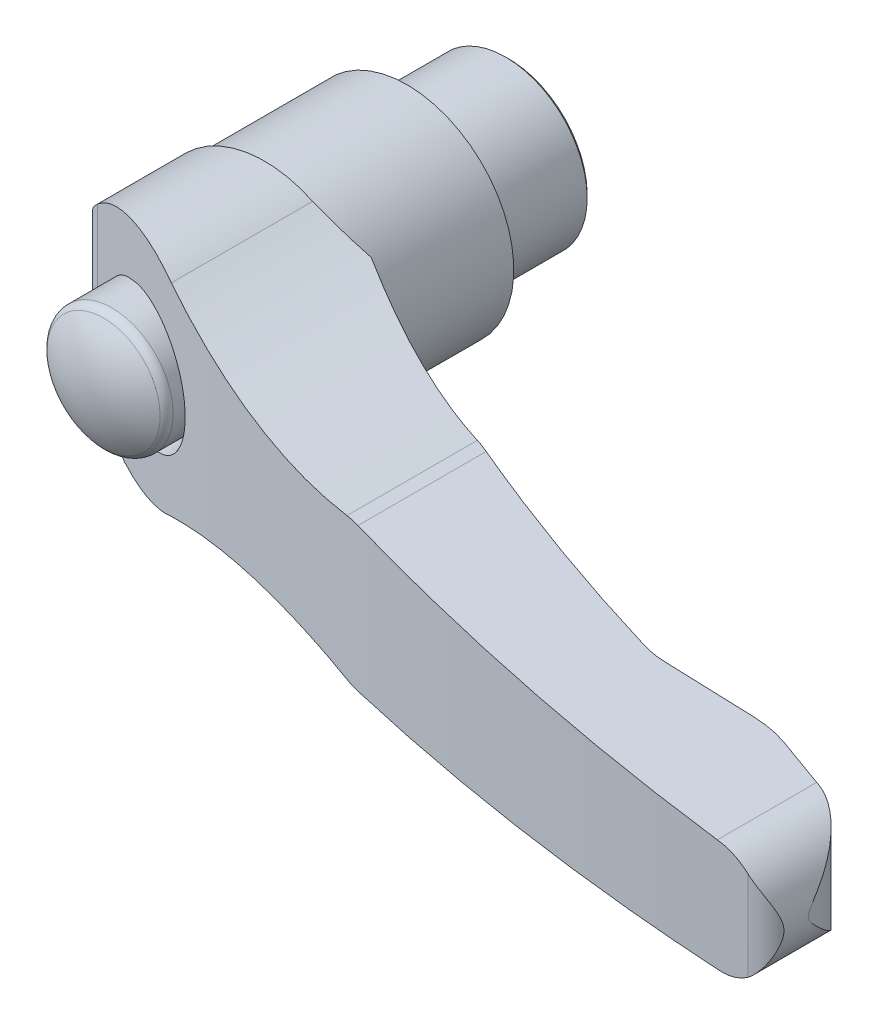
ISO-10303-21;
HEADER;
FILE_DESCRIPTION(('STEP AP214'),'2;1');
FILE_NAME('part.step','',(''),(''),'','','');
FILE_SCHEMA(('AUTOMOTIVE_DESIGN { 1 0 10303 214 1 1 1 1 }'));
ENDSEC;
DATA;
#1=APPLICATION_CONTEXT('core data for automotive mechanical design processes');
#2=APPLICATION_PROTOCOL_DEFINITION('international standard','automotive_design',2000,#1);
#3=PRODUCT_CONTEXT('',#1,'mechanical');
#4=PRODUCT('Part','Part','',(#3));
#5=PRODUCT_RELATED_PRODUCT_CATEGORY('part','',(#4));
#6=PRODUCT_DEFINITION_FORMATION('','',#4);
#7=PRODUCT_DEFINITION_CONTEXT('part definition',#1,'design');
#8=PRODUCT_DEFINITION('design','',#6,#7);
#9=PRODUCT_DEFINITION_SHAPE('','',#8);
#10=(LENGTH_UNIT() NAMED_UNIT(*) SI_UNIT(.MILLI.,.METRE.));
#11=(NAMED_UNIT(*) PLANE_ANGLE_UNIT() SI_UNIT($,.RADIAN.));
#12=(NAMED_UNIT(*) SI_UNIT($,.STERADIAN.) SOLID_ANGLE_UNIT());
#13=UNCERTAINTY_MEASURE_WITH_UNIT(LENGTH_MEASURE(1.E-05),#10,'distance_accuracy_value','');
#14=(GEOMETRIC_REPRESENTATION_CONTEXT(3) GLOBAL_UNCERTAINTY_ASSIGNED_CONTEXT((#13)) GLOBAL_UNIT_ASSIGNED_CONTEXT((#10,
#11,#12)) REPRESENTATION_CONTEXT('',''));
#15=CARTESIAN_POINT('',(0.,0.,0.));
#16=DIRECTION('',(0.,0.,1.));
#17=DIRECTION('',(1.,0.,0.));
#18=AXIS2_PLACEMENT_3D('',#15,#16,#17);
#19=CARTESIAN_POINT('',(3.85,0.,0.));
#20=DIRECTION('',(0.,0.,-1.));
#21=DIRECTION('',(0.,1.,0.));
#22=AXIS2_PLACEMENT_3D('',#19,#20,#21);
#23=PLANE('',#22);
#24=CARTESIAN_POINT('',(0.,0.,0.));
#25=DIRECTION('',(0.,0.,-1.));
#26=DIRECTION('',(0.,1.,0.));
#27=AXIS2_PLACEMENT_3D('',#24,#25,#26);
#28=CIRCLE('',#27,5.64999999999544);
#29=CARTESIAN_POINT('',(0.,5.64999999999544,0.));
#30=VERTEX_POINT('',#29);
#31=EDGE_CURVE('E9',#30,#30,#28,.F.);
#32=ORIENTED_EDGE('',*,*,#31,.T.);
#33=EDGE_LOOP('',(#32));
#34=FACE_BOUND('',#33,.T.);
#35=CARTESIAN_POINT('',(0.,0.,0.));
#36=DIRECTION('',(0.,0.,1.));
#37=DIRECTION('',(0.,-1.,0.));
#38=AXIS2_PLACEMENT_3D('',#35,#36,#37);
#39=CIRCLE('',#38,7.7);
#40=CARTESIAN_POINT('',(0.,-7.7,0.));
#41=VERTEX_POINT('',#40);
#42=EDGE_CURVE('E191',#41,#41,#39,.T.);
#43=ORIENTED_EDGE('',*,*,#42,.F.);
#44=EDGE_LOOP('',(#43));
#45=FACE_BOUND('',#44,.T.);
#46=ADVANCED_FACE('F14',(#34,#45),#23,.T.);
#47=CARTESIAN_POINT('',(0.,0.,0.3));
#48=DIRECTION('',(0.,0.,1.));
#49=DIRECTION('',(0.,-1.,0.));
#50=AXIS2_PLACEMENT_3D('',#47,#48,#49);
#51=CONICAL_SURFACE('',#50,8.,0.785398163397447);
#52=ORIENTED_EDGE('',*,*,#42,.T.);
#53=EDGE_LOOP('',(#52));
#54=FACE_BOUND('',#53,.T.);
#55=CARTESIAN_POINT('',(0.,0.,0.3));
#56=DIRECTION('',(0.,0.,-1.));
#57=DIRECTION('',(0.,1.,0.));
#58=AXIS2_PLACEMENT_3D('',#55,#56,#57);
#59=CIRCLE('',#58,8.);
#60=CARTESIAN_POINT('',(0.,8.,0.3));
#61=VERTEX_POINT('',#60);
#62=EDGE_CURVE('E188',#61,#61,#59,.F.);
#63=ORIENTED_EDGE('',*,*,#62,.F.);
#64=EDGE_LOOP('',(#63));
#65=FACE_BOUND('',#64,.T.);
#66=ADVANCED_FACE('F415',(#54,#65),#51,.T.);
#67=CARTESIAN_POINT('',(0.,0.,11.3));
#68=DIRECTION('',(0.,0.,-1.));
#69=DIRECTION('',(0.,1.,0.));
#70=AXIS2_PLACEMENT_3D('',#67,#68,#69);
#71=CYLINDRICAL_SURFACE('',#70,8.);
#72=ORIENTED_EDGE('',*,*,#62,.T.);
#73=EDGE_LOOP('',(#72));
#74=FACE_BOUND('',#73,.T.);
#75=CARTESIAN_POINT('',(0.,0.,10.7));
#76=DIRECTION('',(0.,0.,-1.));
#77=DIRECTION('',(1.,0.,0.));
#78=AXIS2_PLACEMENT_3D('',#75,#76,#77);
#79=CIRCLE('',#78,8.);
#80=CARTESIAN_POINT('',(8.,0.,10.7));
#81=VERTEX_POINT('',#80);
#82=EDGE_CURVE('E185',#81,#81,#79,.T.);
#83=ORIENTED_EDGE('',*,*,#82,.T.);
#84=EDGE_LOOP('',(#83));
#85=FACE_BOUND('',#84,.T.);
#86=ADVANCED_FACE('F411',(#74,#85),#71,.T.);
#87=CARTESIAN_POINT('',(0.,0.,10.4));
#88=DIRECTION('',(0.,0.,-1.));
#89=DIRECTION('',(0.,1.,0.));
#90=AXIS2_PLACEMENT_3D('',#87,#88,#89);
#91=CONICAL_SURFACE('',#90,8.3,0.785398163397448);
#92=ORIENTED_EDGE('',*,*,#82,.F.);
#93=EDGE_LOOP('',(#92));
#94=FACE_BOUND('',#93,.T.);
#95=CARTESIAN_POINT('',(0.,0.,10.4));
#96=DIRECTION('',(0.,0.,-1.));
#97=DIRECTION('',(0.,1.,0.));
#98=AXIS2_PLACEMENT_3D('',#95,#96,#97);
#99=CIRCLE('',#98,8.3);
#100=CARTESIAN_POINT('',(0.,8.3,10.4));
#101=VERTEX_POINT('',#100);
#102=EDGE_CURVE('E177',#101,#101,#99,.T.);
#103=ORIENTED_EDGE('',*,*,#102,.T.);
#104=EDGE_LOOP('',(#103));
#105=FACE_BOUND('',#104,.T.);
#106=ADVANCED_FACE('F407',(#94,#105),#91,.F.);
#107=CARTESIAN_POINT('',(0.,0.,9.7));
#108=DIRECTION('',(0.,0.,-1.));
#109=DIRECTION('',(0.,1.,0.));
#110=AXIS2_PLACEMENT_3D('',#107,#108,#109);
#111=CYLINDRICAL_SURFACE('',#110,8.3);
#112=ORIENTED_EDGE('',*,*,#102,.F.);
#113=EDGE_LOOP('',(#112));
#114=FACE_BOUND('',#113,.T.);
#115=CARTESIAN_POINT('',(0.,0.,10.));
#116=DIRECTION('',(0.,0.,-1.));
#117=DIRECTION('',(0.,1.,0.));
#118=AXIS2_PLACEMENT_3D('',#115,#116,#117);
#119=CIRCLE('',#118,8.3);
#120=CARTESIAN_POINT('',(0.,8.3,10.));
#121=VERTEX_POINT('',#120);
#122=EDGE_CURVE('E174',#121,#121,#119,.F.);
#123=ORIENTED_EDGE('',*,*,#122,.F.);
#124=EDGE_LOOP('',(#123));
#125=FACE_BOUND('',#124,.T.);
#126=ADVANCED_FACE('F404',(#114,#125),#111,.F.);
#127=CARTESIAN_POINT('',(-5.26,0.,10.));
#128=DIRECTION('',(0.,0.,-1.));
#129=DIRECTION('',(0.,1.,0.));
#130=AXIS2_PLACEMENT_3D('',#127,#128,#129);
#131=PLANE('',#130);
#132=CARTESIAN_POINT('',(-0.00999999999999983,0.,10.));
#133=DIRECTION('',(0.,0.,1.));
#134=DIRECTION('',(-1.,0.,0.));
#135=AXIS2_PLACEMENT_3D('',#132,#133,#134);
#136=CIRCLE('',#135,10.5);
#137=CARTESIAN_POINT('',(-10.2600377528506,-2.27743848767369,10.));
#138=VERTEX_POINT('',#137);
#139=CARTESIAN_POINT('',(-10.2600377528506,2.27743848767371,10.));
#140=VERTEX_POINT('',#139);
#141=EDGE_CURVE('E166',#138,#140,#136,.T.);
#142=ORIENTED_EDGE('',*,*,#141,.F.);
#143=DIRECTION('',(0.,-1.,0.));
#144=VECTOR('',#143,1.);
#145=CARTESIAN_POINT('',(-10.2600377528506,-22.,10.));
#146=LINE('',#145,#144);
#147=EDGE_CURVE('E159',#138,#140,#146,.F.);
#148=ORIENTED_EDGE('',*,*,#147,.T.);
#149=EDGE_LOOP('',(#142,#148));
#150=FACE_BOUND('',#149,.T.);
#151=ORIENTED_EDGE('',*,*,#122,.T.);
#152=EDGE_LOOP('',(#151));
#153=FACE_BOUND('',#152,.T.);
#154=ADVANCED_FACE('F170',(#150,#153),#131,.T.);
#155=CARTESIAN_POINT('',(-10.2600377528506,-22.,10.));
#156=DIRECTION('',(0.707106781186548,0.,0.707106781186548));
#157=DIRECTION('',(-0.707106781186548,0.,0.707106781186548));
#158=AXIS2_PLACEMENT_3D('',#155,#156,#157);
#159=PLANE('',#158);
#160=ORIENTED_EDGE('',*,*,#147,.F.);
#161=CARTESIAN_POINT('',(-0.00999999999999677,0.,-0.250037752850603));
#162=DIRECTION('',(0.707106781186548,0.,0.707106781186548));
#163=DIRECTION('',(-0.707106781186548,0.,0.707106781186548));
#164=AXIS2_PLACEMENT_3D('',#161,#162,#163);
#165=ELLIPSE('',#164,14.8492424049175,10.5);
#166=EDGE_CURVE('E164',#140,#138,#165,.T.);
#167=ORIENTED_EDGE('',*,*,#166,.F.);
#168=EDGE_LOOP('',(#160,#167));
#169=FACE_BOUND('',#168,.T.);
#170=ADVANCED_FACE('F173',(#169),#159,.F.);
#171=CARTESIAN_POINT('',(-0.0100000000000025,0.,18.90625));
#172=DIRECTION('',(0.,0.,1.));
#173=DIRECTION('',(-1.,0.,0.));
#174=AXIS2_PLACEMENT_3D('',#171,#172,#173);
#175=CYLINDRICAL_SURFACE('',#174,10.5);
#176=CARTESIAN_POINT('',(-0.010000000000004,0.,24.));
#177=DIRECTION('',(0.,0.,1.));
#178=DIRECTION('',(-1.,0.,0.));
#179=AXIS2_PLACEMENT_3D('',#176,#177,#178);
#180=CIRCLE('',#179,10.5);
#181=CARTESIAN_POINT('',(-10.51,0.,24.));
#182=VERTEX_POINT('',#181);
#183=CARTESIAN_POINT('',(10.49,0.,24.));
#184=VERTEX_POINT('',#183);
#185=EDGE_CURVE('E168',#182,#184,#180,.T.);
#186=ORIENTED_EDGE('',*,*,#185,.F.);
#187=CARTESIAN_POINT('',(-0.010000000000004,0.,24.));
#188=DIRECTION('',(0.,0.,1.));
#189=DIRECTION('',(-1.,0.,0.));
#190=AXIS2_PLACEMENT_3D('',#187,#188,#189);
#191=CIRCLE('',#190,10.5);
#192=EDGE_CURVE('E367',#184,#182,#191,.T.);
#193=ORIENTED_EDGE('',*,*,#192,.F.);
#194=EDGE_LOOP('',(#186,#193));
#195=FACE_BOUND('',#194,.T.);
#196=ORIENTED_EDGE('',*,*,#141,.T.);
#197=ORIENTED_EDGE('',*,*,#166,.T.);
#198=EDGE_LOOP('',(#196,#197));
#199=FACE_BOUND('',#198,.T.);
#200=ADVANCED_FACE('F165',(#195,#199),#175,.T.);
#201=CARTESIAN_POINT('',(0.,0.,31.5));
#202=DIRECTION('',(1.,0.,0.));
#203=DIRECTION('',(0.,0.,1.));
#204=AXIS2_PLACEMENT_3D('',#201,#202,#203);
#205=SPHERICAL_SURFACE('',#204,10.);
#206=CARTESIAN_POINT('',(0.,0.,39.814794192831));
#207=DIRECTION('',(0.,0.,1.));
#208=DIRECTION('',(0.,-1.,0.));
#209=AXIS2_PLACEMENT_3D('',#206,#207,#208);
#210=CIRCLE('',#209,5.55555555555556);
#211=CARTESIAN_POINT('',(0.,-5.55555555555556,39.814794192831));
#212=VERTEX_POINT('',#211);
#213=EDGE_CURVE('E589',#212,#212,#210,.F.);
#214=ORIENTED_EDGE('',*,*,#213,.F.);
#215=EDGE_LOOP('',(#214));
#216=FACE_BOUND('',#215,.T.);
#217=ADVANCED_FACE('F392',(#216),#205,.T.);
#218=CARTESIAN_POINT('',(-10.51,-12.,24.));
#219=DIRECTION('',(0.,0.,-1.));
#220=DIRECTION('',(0.,1.,0.));
#221=AXIS2_PLACEMENT_3D('',#218,#219,#220);
#222=PLANE('',#221);
#223=ORIENTED_EDGE('',*,*,#185,.T.);
#224=DIRECTION('',(0.,-1.,0.));
#225=VECTOR('',#224,1.);
#226=CARTESIAN_POINT('',(10.4900000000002,-12.,23.9999999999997));
#227=LINE('',#226,#225);
#228=CARTESIAN_POINT('',(10.4900000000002,-8.03465812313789,24.));
#229=VERTEX_POINT('',#228);
#230=EDGE_CURVE('E374',#184,#229,#227,.T.);
#231=ORIENTED_EDGE('',*,*,#230,.T.);
#232=CARTESIAN_POINT('',(22.94,-55.53,24.));
#233=DIRECTION('',(0.,0.,1.));
#234=DIRECTION('',(0.,-1.,0.));
#235=AXIS2_PLACEMENT_3D('',#232,#233,#234);
#236=CIRCLE('',#235,49.1);
#237=CARTESIAN_POINT('',(4.72251026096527,-9.93468151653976,24.));
#238=VERTEX_POINT('',#237);
#239=EDGE_CURVE('E582',#229,#238,#236,.T.);
#240=ORIENTED_EDGE('',*,*,#239,.T.);
#241=CARTESIAN_POINT('',(0.,0.,24.));
#242=DIRECTION('',(0.,0.,1.));
#243=DIRECTION('',(0.,-1.,0.));
#244=AXIS2_PLACEMENT_3D('',#241,#242,#243);
#245=CIRCLE('',#244,11.);
#246=CARTESIAN_POINT('',(-10.51,-3.24652121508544,24.));
#247=VERTEX_POINT('',#246);
#248=EDGE_CURVE('E588',#247,#238,#245,.T.);
#249=ORIENTED_EDGE('',*,*,#248,.F.);
#250=DIRECTION('',(0.,-1.,0.));
#251=VECTOR('',#250,1.);
#252=CARTESIAN_POINT('',(-10.51,-12.,24.));
#253=LINE('',#252,#251);
#254=EDGE_CURVE('E597',#182,#247,#253,.T.);
#255=ORIENTED_EDGE('',*,*,#254,.F.);
#256=EDGE_LOOP('',(#223,#231,#240,#249,#255));
#257=FACE_BOUND('',#256,.T.);
#258=ADVANCED_FACE('F386',(#257),#222,.T.);
#259=CARTESIAN_POINT('',(31.3589689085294,0.945932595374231,54.5));
#260=DIRECTION('',(0.,0.,1.));
#261=DIRECTION('',(0.,-1.,0.));
#262=AXIS2_PLACEMENT_3D('',#259,#260,#261);
#263=CYLINDRICAL_SURFACE('',#262,8.00000000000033);
#264=CARTESIAN_POINT('',(31.6479325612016,-7.04884695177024,46.4731806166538));
#265=CARTESIAN_POINT('',(31.4018180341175,-7.05768532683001,46.4087993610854));
#266=CARTESIAN_POINT('',(31.1563854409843,-7.05525330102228,46.3442255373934));
#267=CARTESIAN_POINT('',(30.66688412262,-7.02784844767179,46.2146927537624));
#268=CARTESIAN_POINT('',(30.4228153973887,-7.00287562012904,46.1497337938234));
#269=CARTESIAN_POINT('',(30.1794286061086,-6.96663239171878,46.0845822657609));
#270=B_SPLINE_CURVE_WITH_KNOTS('',3,(#264,#265,#266,#267,#268,#269),.UNSPECIFIED.,.F.,.F.,(4,2,
4),(0.,0.76139061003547,1.52278122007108),.UNSPECIFIED.);
#271=CARTESIAN_POINT('',(31.6479325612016,-7.04884695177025,46.4731806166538));
#272=VERTEX_POINT('',#271);
#273=CARTESIAN_POINT('',(30.1794286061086,-6.96663239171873,46.084582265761));
#274=VERTEX_POINT('',#273);
#275=EDGE_CURVE('E220',#272,#274,#270,.T.);
#276=ORIENTED_EDGE('',*,*,#275,.T.);
#277=DIRECTION('',(0.,0.,1.));
#278=VECTOR('',#277,1.);
#279=CARTESIAN_POINT('',(30.1794286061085,-6.96663239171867,54.5));
#280=LINE('',#279,#278);
#281=CARTESIAN_POINT('',(30.1794286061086,-6.96663239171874,33.2732494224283));
#282=VERTEX_POINT('',#281);
#283=EDGE_CURVE('E573',#274,#282,#280,.F.);
#284=ORIENTED_EDGE('',*,*,#283,.T.);
#285=CARTESIAN_POINT('',(30.1794286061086,-6.9666323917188,33.2732494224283));
#286=CARTESIAN_POINT('',(30.4222007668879,-7.00282816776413,33.3728739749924));
#287=CARTESIAN_POINT('',(30.6665043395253,-7.02781937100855,33.4725985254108));
#288=CARTESIAN_POINT('',(31.0339219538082,-7.04840105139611,33.6217860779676));
#289=CARTESIAN_POINT('',(31.1565128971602,-7.05244559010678,33.6714318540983));
#290=CARTESIAN_POINT('',(31.4020580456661,-7.05489552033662,33.7706062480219));
#291=CARTESIAN_POINT('',(31.5250125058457,-7.05329063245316,33.8201344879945));
#292=CARTESIAN_POINT('',(31.6479325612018,-7.04884695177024,33.8695155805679));
#293=B_SPLINE_CURVE_WITH_KNOTS('',3,(#285,#286,#287,#288,#289,#290,#291,#292),.UNSPECIFIED.,.F.,
.F.,(4,2,2,4),(0.,0.794258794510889,1.19111760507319,1.58869889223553),.UNSPECIFIED.);
#294=CARTESIAN_POINT('',(31.6479325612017,-7.04884695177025,33.8695155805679));
#295=VERTEX_POINT('',#294);
#296=EDGE_CURVE('E369',#282,#295,#293,.T.);
#297=ORIENTED_EDGE('',*,*,#296,.T.);
#298=DIRECTION('',(0.,0.,1.));
#299=VECTOR('',#298,1.);
#300=CARTESIAN_POINT('',(31.6479325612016,-7.04884695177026,54.5));
#301=LINE('',#300,#299);
#302=EDGE_CURVE('E558',#295,#272,#301,.T.);
#303=ORIENTED_EDGE('',*,*,#302,.T.);
#304=EDGE_LOOP('',(#276,#284,#297,#303));
#305=FACE_BOUND('',#304,.T.);
#306=ADVANCED_FACE('F380',(#305),#263,.T.);
#307=CARTESIAN_POINT('',(79.9967051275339,-12.,50.5395921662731));
#308=DIRECTION('',(0.992331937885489,0.,-0.123601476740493));
#309=DIRECTION('',(0.123601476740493,0.,0.992331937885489));
#310=AXIS2_PLACEMENT_3D('',#307,#308,#309);
#311=PLANE('',#310);
#312=CARTESIAN_POINT('',(79.9967051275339,-0.190348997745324,50.5395921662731));
#313=CARTESIAN_POINT('',(79.996978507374,-0.182455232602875,50.5417865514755));
#314=CARTESIAN_POINT('',(79.9972360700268,-0.174525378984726,50.5438539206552));
#315=CARTESIAN_POINT('',(79.9977166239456,-0.15866415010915,50.5477110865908));
#316=CARTESIAN_POINT('',(79.9979398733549,-0.150733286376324,50.5495029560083));
#317=CARTESIAN_POINT('',(79.9983518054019,-0.134870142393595,50.5528091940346));
#318=CARTESIAN_POINT('',(79.9985407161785,-0.126938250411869,50.554325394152));
#319=CARTESIAN_POINT('',(79.9988840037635,-0.111073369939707,50.5570805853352));
#320=CARTESIAN_POINT('',(79.9990385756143,-0.103140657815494,50.5583211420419));
#321=CARTESIAN_POINT('',(79.9993132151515,-0.0872743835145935,50.5605253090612));
#322=CARTESIAN_POINT('',(79.9994334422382,-0.079341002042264,50.5614901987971));
#323=CARTESIAN_POINT('',(79.9996394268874,-0.0634736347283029,50.5631433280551));
#324=CARTESIAN_POINT('',(79.9997253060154,-0.0555397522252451,50.5638325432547));
#325=CARTESIAN_POINT('',(79.9998626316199,-0.0396716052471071,50.564934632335));
#326=CARTESIAN_POINT('',(79.9999141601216,-0.0317373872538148,50.5653481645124));
#327=CARTESIAN_POINT('',(79.9999828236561,-0.0158687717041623,50.5658992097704));
#328=CARTESIAN_POINT('',(80.,-0.00793438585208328,50.5660370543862));
#329=CARTESIAN_POINT('',(80.,0.00793438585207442,50.5660370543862));
#330=CARTESIAN_POINT('',(79.9999828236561,0.0158687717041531,50.5658992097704));
#331=CARTESIAN_POINT('',(79.9999141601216,0.0317373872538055,50.5653481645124));
#332=CARTESIAN_POINT('',(79.9998626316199,0.0396716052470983,50.564934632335));
#333=CARTESIAN_POINT('',(79.9997253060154,0.0555397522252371,50.5638325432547));
#334=CARTESIAN_POINT('',(79.9996394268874,0.0634736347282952,50.5631433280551));
#335=CARTESIAN_POINT('',(79.9994334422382,0.0793410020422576,50.5614901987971));
#336=CARTESIAN_POINT('',(79.9993132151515,0.0872743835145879,50.5605253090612));
#337=CARTESIAN_POINT('',(79.9990385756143,0.10314065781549,50.5583211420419));
#338=CARTESIAN_POINT('',(79.9988840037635,0.111073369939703,50.5570805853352));
#339=CARTESIAN_POINT('',(79.9985407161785,0.126938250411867,50.554325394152));
#340=CARTESIAN_POINT('',(79.9983518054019,0.134870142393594,50.5528091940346));
#341=CARTESIAN_POINT('',(79.9979398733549,0.150733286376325,50.5495029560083));
#342=CARTESIAN_POINT('',(79.9977166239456,0.158664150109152,50.5477110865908));
#343=CARTESIAN_POINT('',(79.9972360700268,0.17452537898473,50.5438539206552));
#344=CARTESIAN_POINT('',(79.996978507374,0.182455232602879,50.5417865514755));
#345=CARTESIAN_POINT('',(79.9967051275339,0.190348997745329,50.5395921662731));
#346=B_SPLINE_CURVE_WITH_KNOTS('',3,(#312,#313,#314,#315,#316,#317,#318,#319,#320,#321,#322,
#323,#324,#325,#326,#327,#328,#329,#330,#331,#332,#333,#334,#335,#336,#337,#338,#339,#340,#341,
#342,#343,#344,#345),.UNSPECIFIED.,.F.,.F.,(4,2,2,2,2,2,2,2,2,2,2,2,2,2,2,2,4),(0.,
0.0245922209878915,0.0489892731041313,0.0732177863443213,0.0973049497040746,0.121278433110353,
0.145166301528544,0.168996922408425,0.192798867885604,0.216600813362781,0.240431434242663,
0.264319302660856,0.288292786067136,0.312379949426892,0.336608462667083,0.361005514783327,
0.385597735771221),.UNSPECIFIED.);
#347=CARTESIAN_POINT('',(79.9967051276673,-0.190348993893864,50.5395921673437));
#348=VERTEX_POINT('',#347);
#349=CARTESIAN_POINT('',(79.9967051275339,0.190348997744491,50.5395921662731));
#350=VERTEX_POINT('',#349);
#351=EDGE_CURVE('E472',#348,#350,#346,.T.);
#352=ORIENTED_EDGE('',*,*,#351,.F.);
#353=DIRECTION('',(0.,-1.,0.));
#354=VECTOR('',#353,1.);
#355=CARTESIAN_POINT('',(79.9967051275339,-12.,50.5395921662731));
#356=LINE('',#355,#354);
#357=EDGE_CURVE('E553',#350,#348,#356,.T.);
#358=ORIENTED_EDGE('',*,*,#357,.F.);
#359=EDGE_LOOP('',(#352,#358));
#360=FACE_BOUND('',#359,.T.);
#361=ADVANCED_FACE('F385',(#360),#311,.T.);
#362=CARTESIAN_POINT('',(72.6137555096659,-12.,51.4591871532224));
#363=DIRECTION('',(0.,-1.,0.));
#364=DIRECTION('',(1.,0.,0.));
#365=AXIS2_PLACEMENT_3D('',#362,#363,#364);
#366=CYLINDRICAL_SURFACE('',#365,7.44);
#367=CARTESIAN_POINT('',(79.9967051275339,0.190348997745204,50.5395921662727));
#368=CARTESIAN_POINT('',(79.9951469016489,0.235214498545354,50.5270575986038));
#369=CARTESIAN_POINT('',(79.9930953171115,0.278736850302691,50.5108629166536));
#370=CARTESIAN_POINT('',(79.988164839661,0.363077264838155,50.4732708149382));
#371=CARTESIAN_POINT('',(79.9852922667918,0.403913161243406,50.4519133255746));
#372=CARTESIAN_POINT('',(79.975702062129,0.522458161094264,50.3833482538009));
#373=CARTESIAN_POINT('',(79.9679715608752,0.597169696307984,50.3312876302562));
#374=CARTESIAN_POINT('',(79.9508869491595,0.736456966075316,50.2251559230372));
#375=CARTESIAN_POINT('',(79.9416856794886,0.801375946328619,50.1714851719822));
#376=CARTESIAN_POINT('',(79.9214540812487,0.928420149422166,50.0612288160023));
#377=CARTESIAN_POINT('',(79.9104232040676,0.990544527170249,50.0046423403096));
#378=CARTESIAN_POINT('',(79.8746515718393,1.17419942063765,49.8323129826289));
#379=CARTESIAN_POINT('',(79.8472488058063,1.29287988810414,49.7141099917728));
#380=CARTESIAN_POINT('',(79.7848398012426,1.52823594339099,49.4729704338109));
#381=CARTESIAN_POINT('',(79.7496926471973,1.64482416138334,49.3499864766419));
#382=CARTESIAN_POINT('',(79.6721004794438,1.87458318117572,49.1033284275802));
#383=CARTESIAN_POINT('',(79.6296610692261,1.98775652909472,48.9796549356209));
#384=CARTESIAN_POINT('',(79.5033816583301,2.29352791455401,48.6415502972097));
#385=CARTESIAN_POINT('',(79.4120558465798,2.48329449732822,48.427296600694));
#386=CARTESIAN_POINT('',(79.2061355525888,2.85434488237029,48.0023120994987));
#387=CARTESIAN_POINT('',(79.0915236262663,3.03562219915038,47.7915840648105));
#388=CARTESIAN_POINT('',(78.8390032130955,3.38665877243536,47.3777391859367));
#389=CARTESIAN_POINT('',(78.7012752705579,3.55649399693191,47.1745772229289));
#390=CARTESIAN_POINT('',(78.4009143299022,3.8835680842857,46.7768350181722));
#391=CARTESIAN_POINT('',(78.2383021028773,4.04081728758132,46.5822477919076));
#392=CARTESIAN_POINT('',(77.9568022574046,4.2801698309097,46.2794503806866));
#393=CARTESIAN_POINT('',(77.8461272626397,4.36735584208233,46.1675710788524));
#394=CARTESIAN_POINT('',(77.61512986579,4.53501217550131,45.9487274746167));
#395=CARTESIAN_POINT('',(77.494805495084,4.61548112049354,45.8417641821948));
#396=CARTESIAN_POINT('',(77.2447591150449,4.7684092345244,45.6339165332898));
#397=CARTESIAN_POINT('',(77.1150589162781,4.84088606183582,45.5330190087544));
#398=CARTESIAN_POINT('',(76.8461728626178,4.97676025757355,45.3380932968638));
#399=CARTESIAN_POINT('',(76.7069926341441,5.04016294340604,45.2440611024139));
#400=CARTESIAN_POINT('',(76.4438690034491,5.14664435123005,45.0792448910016));
#401=CARTESIAN_POINT('',(76.3213555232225,5.19134589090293,45.0072256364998));
#402=CARTESIAN_POINT('',(76.0703754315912,5.27269544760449,44.8693561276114));
#403=CARTESIAN_POINT('',(75.9419112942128,5.30934677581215,44.8035033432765));
#404=CARTESIAN_POINT('',(75.678496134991,5.37397975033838,44.6781572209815));
#405=CARTESIAN_POINT('',(75.5435027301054,5.40189236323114,44.6187168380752));
#406=CARTESIAN_POINT('',(75.2686009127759,5.44782102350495,44.507386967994));
#407=CARTESIAN_POINT('',(75.1286862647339,5.46582399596,44.4555075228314));
#408=CARTESIAN_POINT('',(74.9868127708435,5.47841339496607,44.407790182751));
#409=B_SPLINE_CURVE_WITH_KNOTS('',3,(#367,#368,#369,#370,#371,#372,#373,#374,#375,#376,#377,
#378,#379,#380,#381,#382,#383,#384,#385,#386,#387,#388,#389,#390,#391,#392,#393,#394,#395,#396,
#397,#398,#399,#400,#401,#402,#403,#404,#405,#406,#407,#408),.UNSPECIFIED.,.F.,.F.,(4,2,2,2,2,2,
2,2,2,2,2,2,2,2,2,2,2,2,2,2,4),(0.,0.139245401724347,0.277446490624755,0.550810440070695,
0.80490688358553,1.05907965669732,1.56794086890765,2.08696422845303,2.60559053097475,
3.50582150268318,4.40672935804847,5.30090298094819,6.1943342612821,6.7336794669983,
7.27313498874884,7.81137365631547,8.3492956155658,8.79580649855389,9.2421333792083,
9.69190199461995,10.1422626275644),.UNSPECIFIED.);
#410=CARTESIAN_POINT('',(74.9868127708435,5.47841339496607,44.407790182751));
#411=VERTEX_POINT('',#410);
#412=EDGE_CURVE('E476',#350,#411,#409,.T.);
#413=ORIENTED_EDGE('',*,*,#412,.F.);
#414=ORIENTED_EDGE('',*,*,#357,.T.);
#415=CARTESIAN_POINT('',(74.9868127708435,-5.47841339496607,44.407790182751));
#416=CARTESIAN_POINT('',(75.1398120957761,-5.46484028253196,44.459242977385));
#417=CARTESIAN_POINT('',(75.2905169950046,-5.44496899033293,44.5155387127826));
#418=CARTESIAN_POINT('',(75.5860882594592,-5.39377415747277,44.6368581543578));
#419=CARTESIAN_POINT('',(75.7309637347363,-5.36246932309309,44.7018674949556));
#420=CARTESIAN_POINT('',(76.0125967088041,-5.28989557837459,44.8390817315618));
#421=CARTESIAN_POINT('',(76.1494251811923,-5.24873835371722,44.9112009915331));
#422=CARTESIAN_POINT('',(76.4161065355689,-5.15736483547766,45.0623731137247));
#423=CARTESIAN_POINT('',(76.5459558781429,-5.10714400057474,45.1414294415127));
#424=CARTESIAN_POINT('',(76.8276536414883,-4.98604991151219,45.3247681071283));
#425=CARTESIAN_POINT('',(76.9775772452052,-4.91309116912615,45.4306358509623));
#426=CARTESIAN_POINT('',(77.265789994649,-4.75681575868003,45.6501400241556));
#427=CARTESIAN_POINT('',(77.4040776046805,-4.67349772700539,45.7637774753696));
#428=CARTESIAN_POINT('',(77.8028296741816,-4.40945601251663,46.1156758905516));
#429=CARTESIAN_POINT('',(78.0457801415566,-4.21527563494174,46.3639882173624));
#430=CARTESIAN_POINT('',(78.417694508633,-3.86589184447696,46.7984433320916));
#431=CARTESIAN_POINT('',(78.5586476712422,-3.71726415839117,46.9799982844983));
#432=CARTESIAN_POINT('',(78.8199419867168,-3.41009407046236,47.3496806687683));
#433=CARTESIAN_POINT('',(78.940273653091,-3.25154715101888,47.537811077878));
#434=CARTESIAN_POINT('',(79.1607378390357,-2.92676895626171,47.9181651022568));
#435=CARTESIAN_POINT('',(79.2609186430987,-2.76055725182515,48.1103776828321));
#436=CARTESIAN_POINT('',(79.4421677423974,-2.42115236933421,48.4974286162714));
#437=CARTESIAN_POINT('',(79.5232445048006,-2.24796232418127,48.692265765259));
#438=CARTESIAN_POINT('',(79.6578968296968,-1.91676087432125,49.0578102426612));
#439=CARTESIAN_POINT('',(79.7136489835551,-1.75958096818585,49.2284695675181));
#440=CARTESIAN_POINT('',(79.786963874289,-1.51825146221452,49.4826945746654));
#441=CARTESIAN_POINT('',(79.8097141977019,-1.43673320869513,49.567289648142));
#442=CARTESIAN_POINT('',(79.8517302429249,-1.27132927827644,49.7350141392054));
#443=CARTESIAN_POINT('',(79.870996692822,-1.18744410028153,49.8181438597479));
#444=CARTESIAN_POINT('',(79.9071865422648,-1.01046435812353,49.9869732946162));
#445=CARTESIAN_POINT('',(79.9238666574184,-0.917129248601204,50.0724723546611));
#446=CARTESIAN_POINT('',(79.9529450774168,-0.724505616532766,50.2358460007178));
#447=CARTESIAN_POINT('',(79.9653823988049,-0.625281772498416,50.3137850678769));
#448=CARTESIAN_POINT('',(79.9802376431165,-0.468580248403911,50.4153149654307));
#449=CARTESIAN_POINT('',(79.9845030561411,-0.416215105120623,50.4460963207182));
#450=CARTESIAN_POINT('',(79.9917045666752,-0.30687937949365,50.4998809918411));
#451=CARTESIAN_POINT('',(79.9946243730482,-0.249861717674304,50.5227881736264));
#452=CARTESIAN_POINT('',(79.9967051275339,-0.190348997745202,50.5395921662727));
#453=B_SPLINE_CURVE_WITH_KNOTS('',3,(#415,#416,#417,#418,#419,#420,#421,#422,#423,#424,#425,
#426,#427,#428,#429,#430,#431,#432,#433,#434,#435,#436,#437,#438,#439,#440,#441,#442,#443,#444,
#445,#446,#447,#448,#449,#450,#451,#452),.UNSPECIFIED.,.F.,.F.,(4,2,2,2,2,2,2,2,2,2,2,2,2,2,2,2,
2,2,4),(0.,0.485611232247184,0.970431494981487,1.44999646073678,1.92980238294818,
2.52141817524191,3.11311192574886,4.30183389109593,5.12208341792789,5.94270927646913,
6.76134473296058,7.57961667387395,8.29494630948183,8.65387747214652,9.01273353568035,
9.39561932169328,9.77488268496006,9.95698827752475,10.141244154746),.UNSPECIFIED.);
#454=CARTESIAN_POINT('',(74.9868127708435,-5.47841339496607,44.407790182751));
#455=VERTEX_POINT('',#454);
#456=EDGE_CURVE('E477',#455,#348,#453,.T.);
#457=ORIENTED_EDGE('',*,*,#456,.F.);
#458=DIRECTION('',(0.,-1.,0.));
#459=VECTOR('',#458,1.);
#460=CARTESIAN_POINT('',(74.9868127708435,-12.,44.407790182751));
#461=LINE('',#460,#459);
#462=EDGE_CURVE('E543',#411,#455,#461,.T.);
#463=ORIENTED_EDGE('',*,*,#462,.F.);
#464=EDGE_LOOP('',(#413,#414,#457,#463));
#465=FACE_BOUND('',#464,.T.);
#466=ADVANCED_FACE('F518',(#465),#366,.T.);
#467=CARTESIAN_POINT('',(57.3760512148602,-12.,33.47));
#468=DIRECTION('',(0.,-1.,0.));
#469=DIRECTION('',(1.,0.,0.));
#470=AXIS2_PLACEMENT_3D('',#467,#468,#469);
#471=CYLINDRICAL_SURFACE('',#470,8.58999999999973);
#472=DIRECTION('',(0.,-1.,0.));
#473=VECTOR('',#472,1.);
#474=CARTESIAN_POINT('',(55.1138126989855,-12.,41.756759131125));
#475=LINE('',#474,#473);
#476=CARTESIAN_POINT('',(55.1138126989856,-6.20069518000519,41.7567591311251));
#477=VERTEX_POINT('',#476);
#478=CARTESIAN_POINT('',(55.1138126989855,6.2006951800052,41.7567591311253));
#479=VERTEX_POINT('',#478);
#480=EDGE_CURVE('E366',#477,#479,#475,.F.);
#481=ORIENTED_EDGE('',*,*,#480,.T.);
#482=CARTESIAN_POINT('',(57.3760512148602,6.11892873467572,33.47));
#483=DIRECTION('',(-0.0361204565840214,-0.999347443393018,0.));
#484=DIRECTION('',(0.999347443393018,-0.0361204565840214,0.));
#485=AXIS2_PLACEMENT_3D('',#482,#483,#484);
#486=ELLIPSE('',#485,8.59560912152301,8.58999999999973);
#487=CARTESIAN_POINT('',(57.3760512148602,6.11892873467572,42.06));
#488=VERTEX_POINT('',#487);
#489=EDGE_CURVE('E465',#479,#488,#486,.F.);
#490=ORIENTED_EDGE('',*,*,#489,.T.);
#491=DIRECTION('',(0.,1.,0.));
#492=VECTOR('',#491,1.);
#493=CARTESIAN_POINT('',(57.3760512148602,-12.,42.06));
#494=LINE('',#493,#492);
#495=CARTESIAN_POINT('',(57.3760512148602,-6.11892873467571,42.06));
#496=VERTEX_POINT('',#495);
#497=EDGE_CURVE('E606',#496,#488,#494,.T.);
#498=ORIENTED_EDGE('',*,*,#497,.F.);
#499=CARTESIAN_POINT('',(57.3760512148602,-6.11892873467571,33.47));
#500=DIRECTION('',(-0.0361204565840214,0.999347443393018,0.));
#501=DIRECTION('',(-0.999347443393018,-0.0361204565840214,0.));
#502=AXIS2_PLACEMENT_3D('',#499,#500,#501);
#503=ELLIPSE('',#502,8.59560912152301,8.58999999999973);
#504=EDGE_CURVE('E563',#496,#477,#503,.F.);
#505=ORIENTED_EDGE('',*,*,#504,.T.);
#506=EDGE_LOOP('',(#481,#490,#498,#505));
#507=FACE_BOUND('',#506,.T.);
#508=ADVANCED_FACE('F522',(#507),#471,.F.);
#509=CARTESIAN_POINT('',(57.3760512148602,-12.,42.06));
#510=DIRECTION('',(0.,0.,-1.));
#511=DIRECTION('',(0.,1.,0.));
#512=AXIS2_PLACEMENT_3D('',#509,#510,#511);
#513=PLANE('',#512);
#514=DIRECTION('',(0.999347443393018,-0.0361204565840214,0.));
#515=VECTOR('',#514,1.);
#516=CARTESIAN_POINT('',(31.6479325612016,7.04884695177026,42.06));
#517=LINE('',#516,#515);
#518=CARTESIAN_POINT('',(66.1633245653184,5.80132115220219,42.06));
#519=VERTEX_POINT('',#518);
#520=EDGE_CURVE('E463',#488,#519,#517,.T.);
#521=ORIENTED_EDGE('',*,*,#520,.T.);
#522=DIRECTION('',(0.,-1.,0.));
#523=VECTOR('',#522,1.);
#524=CARTESIAN_POINT('',(66.1633245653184,-12.,42.06));
#525=LINE('',#524,#523);
#526=CARTESIAN_POINT('',(66.1633245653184,-5.80132115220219,42.06));
#527=VERTEX_POINT('',#526);
#528=EDGE_CURVE('E604',#527,#519,#525,.F.);
#529=ORIENTED_EDGE('',*,*,#528,.F.);
#530=DIRECTION('',(-0.999347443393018,-0.0361204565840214,0.));
#531=VECTOR('',#530,1.);
#532=CARTESIAN_POINT('',(74.5,-5.5,42.06));
#533=LINE('',#532,#531);
#534=EDGE_CURVE('E564',#527,#496,#533,.T.);
#535=ORIENTED_EDGE('',*,*,#534,.T.);
#536=ORIENTED_EDGE('',*,*,#497,.T.);
#537=EDGE_LOOP('',(#521,#529,#535,#536));
#538=FACE_BOUND('',#537,.T.);
#539=ADVANCED_FACE('F527',(#538),#513,.T.);
#540=CARTESIAN_POINT('',(66.1633245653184,-12.,53.34));
#541=DIRECTION('',(0.,-1.,0.));
#542=DIRECTION('',(1.,0.,0.));
#543=AXIS2_PLACEMENT_3D('',#540,#541,#542);
#544=CYLINDRICAL_SURFACE('',#543,11.2800000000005);
#545=CARTESIAN_POINT('',(66.1633245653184,5.80132115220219,53.34));
#546=DIRECTION('',(-0.0361204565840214,-0.999347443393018,0.));
#547=DIRECTION('',(0.999347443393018,-0.0361204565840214,0.));
#548=AXIS2_PLACEMENT_3D('',#545,#546,#547);
#549=ELLIPSE('',#548,11.2873656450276,11.2800000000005);
#550=CARTESIAN_POINT('',(69.7611855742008,5.6712799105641,42.6491723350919));
#551=VERTEX_POINT('',#550);
#552=EDGE_CURVE('E462',#519,#551,#549,.T.);
#553=ORIENTED_EDGE('',*,*,#552,.T.);
#554=DIRECTION('',(0.,-1.,0.));
#555=VECTOR('',#554,1.);
#556=CARTESIAN_POINT('',(69.7611855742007,-12.,42.6491723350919));
#557=LINE('',#556,#555);
#558=CARTESIAN_POINT('',(69.7611855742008,-5.6712799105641,42.6491723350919));
#559=VERTEX_POINT('',#558);
#560=EDGE_CURVE('E550',#559,#551,#557,.F.);
#561=ORIENTED_EDGE('',*,*,#560,.F.);
#562=CARTESIAN_POINT('',(66.1633245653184,-5.80132115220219,53.34));
#563=DIRECTION('',(-0.0361204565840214,0.999347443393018,0.));
#564=DIRECTION('',(-0.999347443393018,-0.0361204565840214,0.));
#565=AXIS2_PLACEMENT_3D('',#562,#563,#564);
#566=ELLIPSE('',#565,11.2873656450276,11.2800000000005);
#567=EDGE_CURVE('E565',#559,#527,#566,.T.);
#568=ORIENTED_EDGE('',*,*,#567,.T.);
#569=ORIENTED_EDGE('',*,*,#528,.T.);
#570=EDGE_LOOP('',(#553,#561,#568,#569));
#571=FACE_BOUND('',#570,.T.);
#572=ADVANCED_FACE('F531',(#571),#544,.T.);
#573=CARTESIAN_POINT('',(69.7611855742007,-12.,42.6491723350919));
#574=DIRECTION('',(0.318959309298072,0.,-0.947768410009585));
#575=DIRECTION('',(0.947768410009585,0.,0.318959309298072));
#576=AXIS2_PLACEMENT_3D('',#573,#574,#575);
#577=PLANE('',#576);
#578=ORIENTED_EDGE('',*,*,#462,.T.);
#579=CARTESIAN_POINT('',(74.5,0.,44.2439595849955));
#580=DIRECTION('',(0.318959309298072,0.,-0.947768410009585));
#581=DIRECTION('',(0.947768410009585,0.,0.318959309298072));
#582=AXIS2_PLACEMENT_3D('',#579,#580,#581);
#583=ELLIPSE('',#582,5.80310542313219,5.5);
#584=CARTESIAN_POINT('',(74.5,-5.5,44.2439595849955));
#585=VERTEX_POINT('',#584);
#586=EDGE_CURVE('E547',#585,#455,#583,.F.);
#587=ORIENTED_EDGE('',*,*,#586,.F.);
#588=DIRECTION('',(-0.947212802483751,-0.0342360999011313,-0.318772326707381));
#589=VECTOR('',#588,1.);
#590=CARTESIAN_POINT('',(74.5,-5.5,44.2439595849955));
#591=LINE('',#590,#589);
#592=EDGE_CURVE('E557',#585,#559,#591,.T.);
#593=ORIENTED_EDGE('',*,*,#592,.T.);
#594=ORIENTED_EDGE('',*,*,#560,.T.);
#595=DIRECTION('',(0.947212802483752,-0.0342360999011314,0.31877232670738));
#596=VECTOR('',#595,1.);
#597=CARTESIAN_POINT('',(69.7611855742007,5.6712799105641,42.6491723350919));
#598=LINE('',#597,#596);
#599=CARTESIAN_POINT('',(74.5,5.5,44.2439595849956));
#600=VERTEX_POINT('',#599);
#601=EDGE_CURVE('E459',#551,#600,#598,.T.);
#602=ORIENTED_EDGE('',*,*,#601,.T.);
#603=CARTESIAN_POINT('',(74.5,0.,44.2439595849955));
#604=DIRECTION('',(0.318959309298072,0.,-0.947768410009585));
#605=DIRECTION('',(0.947768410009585,0.,0.318959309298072));
#606=AXIS2_PLACEMENT_3D('',#603,#604,#605);
#607=ELLIPSE('',#606,5.80310542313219,5.5);
#608=EDGE_CURVE('E511',#411,#600,#607,.F.);
#609=ORIENTED_EDGE('',*,*,#608,.F.);
#610=EDGE_LOOP('',(#578,#587,#593,#594,#602,#609));
#611=FACE_BOUND('',#610,.T.);
#612=ADVANCED_FACE('F534',(#611),#577,.T.);
#613=CARTESIAN_POINT('',(31.3589689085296,-0.945932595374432,54.5));
#614=DIRECTION('',(0.,0.,1.));
#615=DIRECTION('',(0.,-1.,0.));
#616=AXIS2_PLACEMENT_3D('',#613,#614,#615);
#617=CYLINDRICAL_SURFACE('',#616,8.00000000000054);
#618=CARTESIAN_POINT('',(30.1794286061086,6.96663239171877,46.0845822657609));
#619=CARTESIAN_POINT('',(30.4228153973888,7.00287562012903,46.1497337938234));
#620=CARTESIAN_POINT('',(30.66688412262,7.02784844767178,46.2146927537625));
#621=CARTESIAN_POINT('',(31.1563854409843,7.05525330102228,46.3442255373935));
#622=CARTESIAN_POINT('',(31.4018180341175,7.05768532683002,46.4087993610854));
#623=CARTESIAN_POINT('',(31.6479325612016,7.04884695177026,46.4731806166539));
#624=B_SPLINE_CURVE_WITH_KNOTS('',3,(#618,#619,#620,#621,#622,#623),.UNSPECIFIED.,.F.,.F.,(4,2,
4),(0.,0.761390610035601,1.52278122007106),.UNSPECIFIED.);
#625=CARTESIAN_POINT('',(30.1794286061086,6.96663239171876,46.0845822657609));
#626=VERTEX_POINT('',#625);
#627=CARTESIAN_POINT('',(31.6479325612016,7.04884695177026,46.4731806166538));
#628=VERTEX_POINT('',#627);
#629=EDGE_CURVE('E375',#626,#628,#624,.T.);
#630=ORIENTED_EDGE('',*,*,#629,.T.);
#631=DIRECTION('',(0.,0.,1.));
#632=VECTOR('',#631,1.);
#633=CARTESIAN_POINT('',(31.6479325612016,7.04884695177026,54.5));
#634=LINE('',#633,#632);
#635=CARTESIAN_POINT('',(31.6479325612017,7.04884695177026,33.8695155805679));
#636=VERTEX_POINT('',#635);
#637=EDGE_CURVE('E466',#628,#636,#634,.F.);
#638=ORIENTED_EDGE('',*,*,#637,.T.);
#639=CARTESIAN_POINT('',(31.6479325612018,7.04884695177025,33.8695155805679));
#640=CARTESIAN_POINT('',(31.5250125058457,7.05329063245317,33.8201344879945));
#641=CARTESIAN_POINT('',(31.4020580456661,7.05489552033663,33.7706062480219));
#642=CARTESIAN_POINT('',(31.1565128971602,7.05244559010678,33.6714318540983));
#643=CARTESIAN_POINT('',(31.0339219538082,7.04840105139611,33.6217860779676));
#644=CARTESIAN_POINT('',(30.6665043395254,7.02781937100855,33.4725985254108));
#645=CARTESIAN_POINT('',(30.4222007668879,7.00282816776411,33.3728739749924));
#646=CARTESIAN_POINT('',(30.1794286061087,6.96663239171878,33.2732494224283));
#647=B_SPLINE_CURVE_WITH_KNOTS('',3,(#639,#640,#641,#642,#643,#644,#645,#646),.UNSPECIFIED.,.F.,
.F.,(4,2,2,4),(0.,0.39758128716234,0.794440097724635,1.58869889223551),.UNSPECIFIED.);
#648=CARTESIAN_POINT('',(30.1794286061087,6.96663239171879,33.2732494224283));
#649=VERTEX_POINT('',#648);
#650=EDGE_CURVE('E359',#636,#649,#647,.T.);
#651=ORIENTED_EDGE('',*,*,#650,.T.);
#652=DIRECTION('',(0.,0.,1.));
#653=VECTOR('',#652,1.);
#654=CARTESIAN_POINT('',(30.1794286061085,6.96663239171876,54.5));
#655=LINE('',#654,#653);
#656=EDGE_CURVE('E456',#649,#626,#655,.T.);
#657=ORIENTED_EDGE('',*,*,#656,.T.);
#658=EDGE_LOOP('',(#630,#638,#651,#657));
#659=FACE_BOUND('',#658,.T.);
#660=ADVANCED_FACE('F342',(#659),#617,.T.);
#661=CARTESIAN_POINT('',(111.590768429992,-12.,-165.122809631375));
#662=DIRECTION('',(0.,-1.,0.));
#663=DIRECTION('',(1.,0.,0.));
#664=AXIS2_PLACEMENT_3D('',#661,#662,#663);
#665=CYLINDRICAL_SURFACE('',#664,214.45);
#666=ORIENTED_EDGE('',*,*,#650,.F.);
#667=CARTESIAN_POINT('',(111.590768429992,4.15938968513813,-165.122809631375));
#668=DIRECTION('',(-0.0361204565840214,-0.999347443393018,0.));
#669=DIRECTION('',(0.999347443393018,-0.0361204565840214,0.));
#670=AXIS2_PLACEMENT_3D('',#667,#668,#669);
#671=ELLIPSE('',#670,214.590032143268,214.45);
#672=EDGE_CURVE('E468',#636,#479,#671,.F.);
#673=ORIENTED_EDGE('',*,*,#672,.T.);
#674=ORIENTED_EDGE('',*,*,#480,.F.);
#675=CARTESIAN_POINT('',(111.590768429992,-4.15938968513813,-165.122809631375));
#676=DIRECTION('',(-0.0361204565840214,0.999347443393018,0.));
#677=DIRECTION('',(-0.999347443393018,-0.0361204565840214,0.));
#678=AXIS2_PLACEMENT_3D('',#675,#676,#677);
#679=ELLIPSE('',#678,214.590032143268,214.45);
#680=EDGE_CURVE('E560',#477,#295,#679,.F.);
#681=ORIENTED_EDGE('',*,*,#680,.T.);
#682=ORIENTED_EDGE('',*,*,#296,.F.);
#683=CARTESIAN_POINT('',(30.1794286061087,-6.9666323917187,33.2732494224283));
#684=CARTESIAN_POINT('',(29.3385114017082,-6.84126069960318,32.9282027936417));
#685=CARTESIAN_POINT('',(28.4970001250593,-6.73815583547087,32.5766232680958));
#686=CARTESIAN_POINT('',(26.8150445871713,-6.57586454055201,31.8612301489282));
#687=CARTESIAN_POINT('',(25.9746002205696,-6.51667337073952,31.4974178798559));
#688=CARTESIAN_POINT('',(24.3042391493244,-6.44189817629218,30.7615707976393));
#689=CARTESIAN_POINT('',(23.4742949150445,-6.42593469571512,30.3896366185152));
#690=CARTESIAN_POINT('',(21.8194069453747,-6.43581555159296,29.6353273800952));
#691=CARTESIAN_POINT('',(20.994463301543,-6.46166065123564,29.2529521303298));
#692=CARTESIAN_POINT('',(19.3515465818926,-6.55439535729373,28.4787218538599));
#693=CARTESIAN_POINT('',(18.5335723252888,-6.62127786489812,28.0868684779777));
#694=CARTESIAN_POINT('',(16.9061160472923,-6.79528972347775,27.2945449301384));
#695=CARTESIAN_POINT('',(16.0966341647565,-6.90241973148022,26.8940746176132));
#696=CARTESIAN_POINT('',(14.4805646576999,-7.15724867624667,26.0818856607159));
#697=CARTESIAN_POINT('',(13.6740672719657,-7.305300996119,25.6700985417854));
#698=CARTESIAN_POINT('',(12.0728488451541,-7.64070973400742,24.8398212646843));
#699=CARTESIAN_POINT('',(11.2781269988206,-7.82806345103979,24.4213315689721));
#700=CARTESIAN_POINT('',(10.4900000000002,-8.03465812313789,23.9999999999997));
#701=B_SPLINE_CURVE_WITH_KNOTS('',3,(#683,#684,#685,#686,#687,#688,#689,#690,#691,#692,#693,
#694,#695,#696,#697,#698,#699,#700),.UNSPECIFIED.,.F.,.F.,(4,2,2,2,2,2,2,2,4),(0.,
2.75232880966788,5.50436055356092,8.23215522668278,10.9599996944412,13.6873724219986,
16.4147896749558,19.1665377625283,21.9180967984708),.UNSPECIFIED.);
#702=EDGE_CURVE('E349',#282,#229,#701,.T.);
#703=ORIENTED_EDGE('',*,*,#702,.T.);
#704=ORIENTED_EDGE('',*,*,#230,.F.);
#705=DIRECTION('',(0.,1.,0.));
#706=VECTOR('',#705,1.);
#707=CARTESIAN_POINT('',(10.49,-12.,24.));
#708=LINE('',#707,#706);
#709=CARTESIAN_POINT('',(10.49,8.03465812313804,24.));
#710=VERTEX_POINT('',#709);
#711=EDGE_CURVE('E365',#710,#184,#708,.F.);
#712=ORIENTED_EDGE('',*,*,#711,.F.);
#713=CARTESIAN_POINT('',(10.4900000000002,8.03465812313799,23.9999999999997));
#714=CARTESIAN_POINT('',(11.2781269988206,7.82806345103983,24.4213315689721));
#715=CARTESIAN_POINT('',(12.0728488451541,7.64070973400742,24.8398212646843));
#716=CARTESIAN_POINT('',(13.6740672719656,7.30530099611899,25.6700985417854));
#717=CARTESIAN_POINT('',(14.4805646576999,7.15724867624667,26.0818856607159));
#718=CARTESIAN_POINT('',(16.0966341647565,6.90241973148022,26.8940746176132));
#719=CARTESIAN_POINT('',(16.9061160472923,6.79528972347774,27.2945449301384));
#720=CARTESIAN_POINT('',(18.5335723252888,6.62127786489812,28.0868684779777));
#721=CARTESIAN_POINT('',(19.3515465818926,6.55439535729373,28.4787218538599));
#722=CARTESIAN_POINT('',(20.994463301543,6.46166065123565,29.2529521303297));
#723=CARTESIAN_POINT('',(21.8194069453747,6.43581555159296,29.6353273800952));
#724=CARTESIAN_POINT('',(23.4742949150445,6.42593469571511,30.3896366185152));
#725=CARTESIAN_POINT('',(24.3042391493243,6.44189817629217,30.7615707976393));
#726=CARTESIAN_POINT('',(25.9746002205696,6.51667337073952,31.4974178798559));
#727=CARTESIAN_POINT('',(26.8150445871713,6.575864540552,31.8612301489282));
#728=CARTESIAN_POINT('',(28.4970001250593,6.73815583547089,32.5766232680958));
#729=CARTESIAN_POINT('',(29.3385114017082,6.84126069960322,32.9282027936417));
#730=CARTESIAN_POINT('',(30.1794286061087,6.96663239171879,33.2732494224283));
#731=B_SPLINE_CURVE_WITH_KNOTS('',3,(#713,#714,#715,#716,#717,#718,#719,#720,#721,#722,#723,
#724,#725,#726,#727,#728,#729,#730),.UNSPECIFIED.,.F.,.F.,(4,2,2,2,2,2,2,2,4),(0.,
2.75155903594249,5.50330712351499,8.23072437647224,10.9580971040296,13.685941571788,
16.4137362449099,19.1657679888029,21.9180967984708),.UNSPECIFIED.);
#732=EDGE_CURVE('E326',#710,#649,#731,.T.);
#733=ORIENTED_EDGE('',*,*,#732,.T.);
#734=EDGE_LOOP('',(#666,#673,#674,#681,#682,#703,#704,#712,#733));
#735=FACE_BOUND('',#734,.T.);
#736=ADVANCED_FACE('F336',(#735),#665,.F.);
#737=CARTESIAN_POINT('',(-10.51,-12.,24.));
#738=DIRECTION('',(0.,0.,-1.));
#739=DIRECTION('',(0.,1.,0.));
#740=AXIS2_PLACEMENT_3D('',#737,#738,#739);
#741=PLANE('',#740);
#742=DIRECTION('',(0.,-1.,0.));
#743=VECTOR('',#742,1.);
#744=CARTESIAN_POINT('',(-10.51,-12.,24.));
#745=LINE('',#744,#743);
#746=CARTESIAN_POINT('',(-10.51,3.24652121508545,24.));
#747=VERTEX_POINT('',#746);
#748=EDGE_CURVE('E594',#747,#182,#745,.T.);
#749=ORIENTED_EDGE('',*,*,#748,.F.);
#750=CARTESIAN_POINT('',(0.,0.,24.));
#751=DIRECTION('',(0.,0.,1.));
#752=DIRECTION('',(0.,-1.,0.));
#753=AXIS2_PLACEMENT_3D('',#750,#751,#752);
#754=CIRCLE('',#753,11.);
#755=CARTESIAN_POINT('',(4.72251026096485,9.93468151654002,24.));
#756=VERTEX_POINT('',#755);
#757=EDGE_CURVE('E305',#756,#747,#754,.T.);
#758=ORIENTED_EDGE('',*,*,#757,.F.);
#759=CARTESIAN_POINT('',(22.94,55.53,24.));
#760=DIRECTION('',(0.,0.,1.));
#761=DIRECTION('',(0.,-1.,0.));
#762=AXIS2_PLACEMENT_3D('',#759,#760,#761);
#763=CIRCLE('',#762,49.1);
#764=EDGE_CURVE('E334',#756,#710,#763,.T.);
#765=ORIENTED_EDGE('',*,*,#764,.T.);
#766=ORIENTED_EDGE('',*,*,#711,.T.);
#767=ORIENTED_EDGE('',*,*,#192,.T.);
#768=EDGE_LOOP('',(#749,#758,#765,#766,#767));
#769=FACE_BOUND('',#768,.T.);
#770=ADVANCED_FACE('F341',(#769),#741,.T.);
#771=CARTESIAN_POINT('',(-10.51,-12.,28.3184975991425));
#772=DIRECTION('',(-1.,0.,0.));
#773=DIRECTION('',(0.,-1.,0.));
#774=AXIS2_PLACEMENT_3D('',#771,#772,#773);
#775=PLANE('',#774);
#776=ORIENTED_EDGE('',*,*,#748,.T.);
#777=ORIENTED_EDGE('',*,*,#254,.T.);
#778=DIRECTION('',(0.,0.,1.));
#779=VECTOR('',#778,1.);
#780=CARTESIAN_POINT('',(-10.51,-3.24652121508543,54.5));
#781=LINE('',#780,#779);
#782=CARTESIAN_POINT('',(-10.51,-3.24652121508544,28.3184975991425));
#783=VERTEX_POINT('',#782);
#784=EDGE_CURVE('E586',#783,#247,#781,.F.);
#785=ORIENTED_EDGE('',*,*,#784,.F.);
#786=DIRECTION('',(0.,-1.,0.));
#787=VECTOR('',#786,1.);
#788=CARTESIAN_POINT('',(-10.51,-12.,28.3184975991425));
#789=LINE('',#788,#787);
#790=CARTESIAN_POINT('',(-10.51,3.24652121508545,28.3184975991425));
#791=VERTEX_POINT('',#790);
#792=EDGE_CURVE('E449',#791,#783,#789,.T.);
#793=ORIENTED_EDGE('',*,*,#792,.F.);
#794=DIRECTION('',(0.,0.,1.));
#795=VECTOR('',#794,1.);
#796=CARTESIAN_POINT('',(-10.51,3.24652121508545,54.5));
#797=LINE('',#796,#795);
#798=EDGE_CURVE('E454',#747,#791,#797,.T.);
#799=ORIENTED_EDGE('',*,*,#798,.F.);
#800=EDGE_LOOP('',(#776,#777,#785,#793,#799));
#801=FACE_BOUND('',#800,.T.);
#802=ADVANCED_FACE('F711',(#801),#775,.T.);
#803=CARTESIAN_POINT('',(0.,0.,38.9833147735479));
#804=DIRECTION('',(0.,0.,1.));
#805=DIRECTION('',(0.,-1.,0.));
#806=AXIS2_PLACEMENT_3D('',#803,#804,#805);
#807=TOROIDAL_SURFACE('',#806,5.,1.);
#808=CARTESIAN_POINT('',(0.,0.,38.9833147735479));
#809=DIRECTION('',(0.,0.,-1.));
#810=DIRECTION('',(0.,1.,0.));
#811=AXIS2_PLACEMENT_3D('',#808,#809,#810);
#812=CIRCLE('',#811,6.);
#813=CARTESIAN_POINT('',(0.,6.,38.9833147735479));
#814=VERTEX_POINT('',#813);
#815=EDGE_CURVE('E446',#814,#814,#812,.T.);
#816=ORIENTED_EDGE('',*,*,#815,.F.);
#817=EDGE_LOOP('',(#816));
#818=FACE_BOUND('',#817,.T.);
#819=ORIENTED_EDGE('',*,*,#213,.T.);
#820=EDGE_LOOP('',(#819));
#821=FACE_BOUND('',#820,.T.);
#822=ADVANCED_FACE('F290',(#818,#821),#807,.T.);
#823=CARTESIAN_POINT('',(0.,0.,54.5));
#824=DIRECTION('',(0.,0.,1.));
#825=DIRECTION('',(0.,-1.,0.));
#826=AXIS2_PLACEMENT_3D('',#823,#824,#825);
#827=CYLINDRICAL_SURFACE('',#826,11.);
#828=DIRECTION('',(0.,0.,1.));
#829=VECTOR('',#828,1.);
#830=CARTESIAN_POINT('',(4.72251026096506,-9.93468151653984,54.5));
#831=LINE('',#830,#829);
#832=CARTESIAN_POINT('',(4.72251026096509,-9.93468151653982,37.8817401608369));
#833=VERTEX_POINT('',#832);
#834=EDGE_CURVE('E578',#238,#833,#831,.T.);
#835=ORIENTED_EDGE('',*,*,#834,.T.);
#836=CARTESIAN_POINT('',(-7.5096417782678,-8.03774099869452,32.901229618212));
#837=CARTESIAN_POINT('',(-7.30119190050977,-8.23251249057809,32.9921873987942));
#838=CARTESIAN_POINT('',(-7.08580726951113,-8.41854156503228,33.0858493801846));
#839=CARTESIAN_POINT('',(-6.64267022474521,-8.77241261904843,33.2778169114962));
#840=CARTESIAN_POINT('',(-6.41492246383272,-8.94026137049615,33.3761207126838));
#841=CARTESIAN_POINT('',(-5.94857507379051,-9.25709911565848,33.5766021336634));
#842=CARTESIAN_POINT('',(-5.7099835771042,-9.40610193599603,33.678776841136));
#843=CARTESIAN_POINT('',(-5.223147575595,-9.68490755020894,33.8863852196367));
#844=CARTESIAN_POINT('',(-4.97490128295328,-9.81470676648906,33.9918194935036));
#845=CARTESIAN_POINT('',(-4.42101783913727,-10.0779967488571,34.2260374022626));
#846=CARTESIAN_POINT('',(-4.11361114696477,-10.2072930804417,34.3553730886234));
#847=CARTESIAN_POINT('',(-3.48919697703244,-10.4372536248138,34.6166621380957));
#848=CARTESIAN_POINT('',(-3.17218533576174,-10.5379052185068,34.7486166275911));
#849=CARTESIAN_POINT('',(-2.53069009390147,-10.7100879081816,35.0141488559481));
#850=CARTESIAN_POINT('',(-2.20620056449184,-10.7815949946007,35.1477278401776));
#851=CARTESIAN_POINT('',(-1.55229642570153,-10.8949753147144,35.4153807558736));
#852=CARTESIAN_POINT('',(-1.22288191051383,-10.9368491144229,35.5494546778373));
#853=CARTESIAN_POINT('',(-0.561270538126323,-10.9906860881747,35.8171796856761));
#854=CARTESIAN_POINT('',(-0.229072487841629,-11.0026357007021,35.9508305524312));
#855=CARTESIAN_POINT('',(0.435501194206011,-10.9963958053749,36.2166469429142));
#856=CARTESIAN_POINT('',(0.767876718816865,-10.9782171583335,36.3488129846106));
#857=CARTESIAN_POINT('',(1.43012152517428,-10.9117075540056,36.6106147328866));
#858=CARTESIAN_POINT('',(1.75999341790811,-10.8634142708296,36.7402533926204));
#859=CARTESIAN_POINT('',(2.41508032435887,-10.7367884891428,36.9962131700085));
#860=CARTESIAN_POINT('',(2.7402972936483,-10.658469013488,37.1225357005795));
#861=CARTESIAN_POINT('',(3.34557190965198,-10.483048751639,37.3563007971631));
#862=CARTESIAN_POINT('',(3.62641666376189,-10.3892703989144,37.4642076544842));
#863=CARTESIAN_POINT('',(4.18049609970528,-10.1789602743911,37.6760526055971));
#864=CARTESIAN_POINT('',(4.4537405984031,-10.0624595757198,37.7799958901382));
#865=CARTESIAN_POINT('',(4.72251026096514,-9.93468151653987,37.8817401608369));
#866=B_SPLINE_CURVE_WITH_KNOTS('',3,(#836,#837,#838,#839,#840,#841,#842,#843,#844,#845,#846,
#847,#848,#849,#850,#851,#852,#853,#854,#855,#856,#857,#858,#859,#860,#861,#862,#863,#864,#865),
.UNSPECIFIED.,.F.,.F.,(4,2,2,2,2,2,2,2,2,2,2,2,2,2,4),(0.,0.898027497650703,1.7957193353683,
2.69274869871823,3.58994496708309,4.66168624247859,5.73389893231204,6.80699314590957,
7.88006686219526,8.95362680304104,10.026799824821,11.0986329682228,12.1700017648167,
13.1144975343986,14.0577106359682),.UNSPECIFIED.);
#867=CARTESIAN_POINT('',(-7.50964177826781,-8.0377409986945,32.9012296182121));
#868=VERTEX_POINT('',#867);
#869=EDGE_CURVE('E271',#868,#833,#866,.T.);
#870=ORIENTED_EDGE('',*,*,#869,.F.);
#871=CARTESIAN_POINT('',(-10.51,-3.24652121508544,28.3184975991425));
#872=CARTESIAN_POINT('',(-10.5100124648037,-3.24646509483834,28.3732623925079));
#873=CARTESIAN_POINT('',(-10.5091007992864,-3.24943230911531,28.427986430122));
#874=CARTESIAN_POINT('',(-10.5055310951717,-3.26096293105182,28.5366267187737));
#875=CARTESIAN_POINT('',(-10.502878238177,-3.26950973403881,28.5905448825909));
#876=CARTESIAN_POINT('',(-10.4960071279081,-3.29149734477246,28.6959484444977));
#877=CARTESIAN_POINT('',(-10.4918263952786,-3.30482071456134,28.7474612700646));
#878=CARTESIAN_POINT('',(-10.4820319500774,-3.33575653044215,28.8490671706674));
#879=CARTESIAN_POINT('',(-10.4764171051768,-3.35337236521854,28.8991590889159));
#880=CARTESIAN_POINT('',(-10.4613570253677,-3.40012148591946,29.0177441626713));
#881=CARTESIAN_POINT('',(-10.4512819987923,-3.43102782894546,29.0854568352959));
#882=CARTESIAN_POINT('',(-10.4289404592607,-3.49835238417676,29.2176755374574));
#883=CARTESIAN_POINT('',(-10.4166729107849,-3.53477319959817,29.2821800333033));
#884=CARTESIAN_POINT('',(-10.3767057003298,-3.65111972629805,29.4727055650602));
#885=CARTESIAN_POINT('',(-10.3460523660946,-3.73745143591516,29.5941883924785));
#886=CARTESIAN_POINT('',(-10.2889759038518,-3.89120940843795,29.791023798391));
#887=CARTESIAN_POINT('',(-10.2642190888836,-3.95612508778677,29.868938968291));
#888=CARTESIAN_POINT('',(-10.2119205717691,-4.08922789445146,30.0209661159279));
#889=CARTESIAN_POINT('',(-10.1843787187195,-4.15741519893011,30.095077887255));
#890=CARTESIAN_POINT('',(-10.0977335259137,-4.36558474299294,30.3127886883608));
#891=CARTESIAN_POINT('',(-10.0346783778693,-4.50898846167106,30.4515363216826));
#892=CARTESIAN_POINT('',(-9.89857038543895,-4.8004472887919,30.7191104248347));
#893=CARTESIAN_POINT('',(-9.82550575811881,-4.9485077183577,30.8479249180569));
#894=CARTESIAN_POINT('',(-9.66961187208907,-5.24660819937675,31.0968363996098));
#895=CARTESIAN_POINT('',(-9.58678804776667,-5.39664710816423,31.2169381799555));
#896=CARTESIAN_POINT('',(-9.37347141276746,-5.76194438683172,31.4992210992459));
#897=CARTESIAN_POINT('',(-9.23781739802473,-5.9774444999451,31.6572316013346));
#898=CARTESIAN_POINT('',(-8.94599357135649,-6.40597258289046,31.9568555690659));
#899=CARTESIAN_POINT('',(-8.7898215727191,-6.61900028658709,32.0984672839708));
#900=CARTESIAN_POINT('',(-8.45829926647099,-7.03758557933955,32.3622429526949));
#901=CARTESIAN_POINT('',(-8.28318100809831,-7.24319983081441,32.484605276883));
#902=CARTESIAN_POINT('',(-8.00491886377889,-7.54586668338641,32.6529109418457));
#903=CARTESIAN_POINT('',(-7.9095084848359,-7.64585192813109,32.7064994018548));
#904=CARTESIAN_POINT('',(-7.71347816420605,-7.84357311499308,32.8081370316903));
#905=CARTESIAN_POINT('',(-7.61285650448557,-7.94130829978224,32.8561843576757));
#906=CARTESIAN_POINT('',(-7.50964177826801,-8.03774099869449,32.9012296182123));
#907=B_SPLINE_CURVE_WITH_KNOTS('',3,(#871,#872,#873,#874,#875,#876,#877,#878,#879,#880,#881,
#882,#883,#884,#885,#886,#887,#888,#889,#890,#891,#892,#893,#894,#895,#896,#897,#898,#899,#900,
#901,#902,#903,#904,#905,#906),.UNSPECIFIED.,.F.,.F.,(4,2,2,2,2,2,2,2,2,2,2,2,2,2,2,2,2,4),(0.,
0.164141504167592,0.327796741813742,0.487676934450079,0.647683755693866,0.872613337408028,
1.09764943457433,1.55278179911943,1.86584508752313,2.17892534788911,2.80598559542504,
3.43379045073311,4.06124735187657,4.95910359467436,5.85705560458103,6.74504320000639,
7.18954432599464,7.63419293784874),.UNSPECIFIED.);
#908=EDGE_CURVE('E297',#783,#868,#907,.T.);
#909=ORIENTED_EDGE('',*,*,#908,.F.);
#910=ORIENTED_EDGE('',*,*,#784,.T.);
#911=ORIENTED_EDGE('',*,*,#248,.T.);
#912=EDGE_LOOP('',(#835,#870,#909,#910,#911));
#913=FACE_BOUND('',#912,.T.);
#914=ADVANCED_FACE('F285',(#913),#827,.T.);
#915=CARTESIAN_POINT('',(22.94,-55.53,54.5));
#916=DIRECTION('',(0.,0.,1.));
#917=DIRECTION('',(0.,-1.,0.));
#918=AXIS2_PLACEMENT_3D('',#915,#916,#917);
#919=CYLINDRICAL_SURFACE('',#918,49.1);
#920=ORIENTED_EDGE('',*,*,#283,.F.);
#921=CARTESIAN_POINT('',(4.72251026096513,-9.93468151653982,37.8817401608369));
#922=CARTESIAN_POINT('',(5.38601967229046,-9.66958454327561,38.1329285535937));
#923=CARTESIAN_POINT('',(6.05547912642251,-9.41889501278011,38.3833346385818));
#924=CARTESIAN_POINT('',(7.40543727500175,-8.94675230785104,38.8820168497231));
#925=CARTESIAN_POINT('',(8.08593633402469,-8.72530010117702,39.1302929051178));
#926=CARTESIAN_POINT('',(10.1431096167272,-8.1053136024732,39.8712239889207));
#927=CARTESIAN_POINT('',(11.5349994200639,-7.75133354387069,40.3598072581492));
#928=CARTESIAN_POINT('',(14.3196466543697,-7.17216929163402,41.310919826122));
#929=CARTESIAN_POINT('',(15.7117617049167,-6.94441673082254,41.7737817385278));
#930=CARTESIAN_POINT('',(18.5161183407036,-6.60933679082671,42.6802593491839));
#931=CARTESIAN_POINT('',(19.9283492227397,-6.50194762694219,43.12388480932));
#932=CARTESIAN_POINT('',(22.0758785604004,-6.43216342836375,43.7788145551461));
#933=CARTESIAN_POINT('',(22.8074388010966,-6.42471520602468,43.9984832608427));
#934=CARTESIAN_POINT('',(24.2719625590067,-6.44260972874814,44.4313921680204));
#935=CARTESIAN_POINT('',(25.0049257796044,-6.46794617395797,44.644633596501));
#936=CARTESIAN_POINT('',(26.4790301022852,-6.55208369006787,45.0666464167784));
#937=CARTESIAN_POINT('',(27.2201718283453,-6.6112524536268,45.2753420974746));
#938=CARTESIAN_POINT('',(28.701183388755,-6.76348158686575,45.6854942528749));
#939=CARTESIAN_POINT('',(29.4410528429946,-6.85655075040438,45.8869488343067));
#940=CARTESIAN_POINT('',(30.1794286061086,-6.96663239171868,46.084582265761));
#941=B_SPLINE_CURVE_WITH_KNOTS('',3,(#921,#922,#923,#924,#925,#926,#927,#928,#929,#930,#931,
#932,#933,#934,#935,#936,#937,#938,#939,#940),.UNSPECIFIED.,.F.,.F.,(4,2,2,2,2,2,2,2,2,4),(0.,
2.2717817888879,4.54363875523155,9.08892529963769,13.5379720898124,17.9847340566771,
20.2757253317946,22.5662764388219,24.8822079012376,27.1987405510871),.UNSPECIFIED.);
#942=EDGE_CURVE('E264',#833,#274,#941,.T.);
#943=ORIENTED_EDGE('',*,*,#942,.F.);
#944=ORIENTED_EDGE('',*,*,#834,.F.);
#945=ORIENTED_EDGE('',*,*,#239,.F.);
#946=ORIENTED_EDGE('',*,*,#702,.F.);
#947=EDGE_LOOP('',(#920,#943,#944,#945,#946));
#948=FACE_BOUND('',#947,.T.);
#949=ADVANCED_FACE('F289',(#948),#919,.F.);
#950=CARTESIAN_POINT('',(74.5,-5.5,54.5));
#951=DIRECTION('',(-0.0361204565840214,0.999347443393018,0.));
#952=DIRECTION('',(-0.999347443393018,-0.0361204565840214,0.));
#953=AXIS2_PLACEMENT_3D('',#950,#951,#952);
#954=PLANE('',#953);
#955=DIRECTION('',(0.,0.,1.));
#956=VECTOR('',#955,1.);
#957=CARTESIAN_POINT('',(74.5,-5.5,54.5));
#958=LINE('',#957,#956);
#959=CARTESIAN_POINT('',(74.5,-5.5,54.0125431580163));
#960=VERTEX_POINT('',#959);
#961=EDGE_CURVE('E471',#960,#585,#958,.F.);
#962=ORIENTED_EDGE('',*,*,#961,.F.);
#963=CARTESIAN_POINT('',(99.1192564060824,-4.61016054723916,-211.468372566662));
#964=DIRECTION('',(-0.0361204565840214,0.999347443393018,0.));
#965=DIRECTION('',(-0.999347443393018,-0.0361204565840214,0.));
#966=AXIS2_PLACEMENT_3D('',#963,#964,#965);
#967=ELLIPSE('',#966,266.794098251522,266.620000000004);
#968=EDGE_CURVE('E623',#272,#960,#967,.T.);
#969=ORIENTED_EDGE('',*,*,#968,.F.);
#970=ORIENTED_EDGE('',*,*,#302,.F.);
#971=ORIENTED_EDGE('',*,*,#680,.F.);
#972=ORIENTED_EDGE('',*,*,#504,.F.);
#973=ORIENTED_EDGE('',*,*,#534,.F.);
#974=ORIENTED_EDGE('',*,*,#567,.F.);
#975=ORIENTED_EDGE('',*,*,#592,.F.);
#976=EDGE_LOOP('',(#962,#969,#970,#971,#972,#973,#974,#975));
#977=FACE_BOUND('',#976,.T.);
#978=ADVANCED_FACE('F633',(#977),#954,.F.);
#979=CARTESIAN_POINT('',(77.9746679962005,-12.,52.1048483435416));
#980=DIRECTION('',(0.,-1.,0.));
#981=DIRECTION('',(1.,0.,0.));
#982=AXIS2_PLACEMENT_3D('',#979,#980,#981);
#983=CYLINDRICAL_SURFACE('',#982,2.2);
#984=CARTESIAN_POINT('',(77.7987429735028,4.40094248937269,54.297803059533));
#985=CARTESIAN_POINT('',(77.8739298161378,4.3446103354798,54.3038288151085));
#986=CARTESIAN_POINT('',(77.947791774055,4.28621521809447,54.3058709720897));
#987=CARTESIAN_POINT('',(78.0922208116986,4.16589830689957,54.3028912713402));
#988=CARTESIAN_POINT('',(78.1627937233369,4.10398322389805,54.2978824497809));
#989=CARTESIAN_POINT('',(78.2996338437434,3.97761161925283,54.2817956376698));
#990=CARTESIAN_POINT('',(78.3659353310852,3.91318450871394,54.2707752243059));
#991=CARTESIAN_POINT('',(78.4947211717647,3.78162408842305,54.2435114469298));
#992=CARTESIAN_POINT('',(78.5572032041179,3.71448917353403,54.2272649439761));
#993=CARTESIAN_POINT('',(78.7037263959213,3.54901721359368,54.1824837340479));
#994=CARTESIAN_POINT('',(78.7857223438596,3.44948168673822,54.1516573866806));
#995=CARTESIAN_POINT('',(78.9414411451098,3.24653335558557,54.0828783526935));
#996=CARTESIAN_POINT('',(79.0151615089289,3.14311939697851,54.0449235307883));
#997=CARTESIAN_POINT('',(79.2246832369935,2.82692774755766,53.9224540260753));
#998=CARTESIAN_POINT('',(79.3481089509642,2.60904238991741,53.829588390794));
#999=CARTESIAN_POINT('',(79.5118173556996,2.26904106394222,53.6805956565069));
#1000=CARTESIAN_POINT('',(79.5637254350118,2.15065893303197,53.6280001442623));
#1001=CARTESIAN_POINT('',(79.6590195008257,1.9108045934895,53.5218995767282));
#1002=CARTESIAN_POINT('',(79.7024022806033,1.78933124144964,53.4683941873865));
#1003=CARTESIAN_POINT('',(79.7806945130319,1.54303752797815,53.3628544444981));
#1004=CARTESIAN_POINT('',(79.815603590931,1.41821701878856,53.310820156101));
#1005=CARTESIAN_POINT('',(79.8768533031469,1.16468164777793,53.2116769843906));
#1006=CARTESIAN_POINT('',(79.903199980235,1.03596960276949,53.1645646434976));
#1007=CARTESIAN_POINT('',(79.950229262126,0.753846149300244,53.0744438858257));
#1008=CARTESIAN_POINT('',(79.969491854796,0.599603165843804,53.0330810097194));
#1009=CARTESIAN_POINT('',(79.9884623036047,0.364537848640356,52.9907827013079));
#1010=CARTESIAN_POINT('',(79.9931327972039,0.285927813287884,52.9799792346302));
#1011=CARTESIAN_POINT('',(79.9990802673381,0.127898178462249,52.9661347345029));
#1012=CARTESIAN_POINT('',(80.0003586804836,0.0484789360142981,52.9630904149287));
#1013=CARTESIAN_POINT('',(79.9994656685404,-0.110643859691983,52.9651940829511));
#1014=CARTESIAN_POINT('',(79.9972760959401,-0.190346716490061,52.970385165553));
#1015=CARTESIAN_POINT('',(79.9895067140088,-0.348729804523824,52.9883178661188));
#1016=CARTESIAN_POINT('',(79.9839252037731,-0.427409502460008,53.0010632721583));
#1017=CARTESIAN_POINT('',(79.9622241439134,-0.662630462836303,53.0486779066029));
#1018=CARTESIAN_POINT('',(79.9411622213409,-0.816788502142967,53.0928557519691));
#1019=CARTESIAN_POINT('',(79.88839520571,-1.11212828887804,53.1914221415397));
#1020=CARTESIAN_POINT('',(79.8571693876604,-1.25358307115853,53.2453093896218));
#1021=CARTESIAN_POINT('',(79.784282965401,-1.53200335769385,53.3577691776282));
#1022=CARTESIAN_POINT('',(79.7426130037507,-1.66896471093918,53.4163458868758));
#1023=CARTESIAN_POINT('',(79.6489027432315,-1.93886019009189,53.534043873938));
#1024=CARTESIAN_POINT('',(79.5968732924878,-2.07179836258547,53.5931645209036));
#1025=CARTESIAN_POINT('',(79.4822877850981,-2.33393789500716,53.7091354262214));
#1026=CARTESIAN_POINT('',(79.4197377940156,-2.46314135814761,53.7659869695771));
#1027=CARTESIAN_POINT('',(79.2437827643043,-2.79266636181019,53.907207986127));
#1028=CARTESIAN_POINT('',(79.1220745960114,-2.99022899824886,53.9881481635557));
#1029=CARTESIAN_POINT('',(78.9187262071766,-3.27696925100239,54.093454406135));
#1030=CARTESIAN_POINT('',(78.8476226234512,-3.37079169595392,54.125829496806));
#1031=CARTESIAN_POINT('',(78.6984500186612,-3.55485935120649,54.1839198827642));
#1032=CARTESIAN_POINT('',(78.6203863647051,-3.64510724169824,54.2096402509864));
#1033=CARTESIAN_POINT('',(78.4833241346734,-3.7933952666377,54.2460114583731));
#1034=CARTESIAN_POINT('',(78.4261294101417,-3.85257392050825,54.2588546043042));
#1035=CARTESIAN_POINT('',(78.3087404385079,-3.96866565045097,54.2801534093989));
#1036=CARTESIAN_POINT('',(78.2485476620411,-4.02557981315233,54.2886111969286));
#1037=CARTESIAN_POINT('',(78.1248892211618,-4.13728909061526,54.300599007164));
#1038=CARTESIAN_POINT('',(78.0614020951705,-4.19206473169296,54.3040909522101));
#1039=CARTESIAN_POINT('',(77.9318740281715,-4.29875909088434,54.3053863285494));
#1040=CARTESIAN_POINT('',(77.865829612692,-4.35067367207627,54.3031817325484));
#1041=CARTESIAN_POINT('',(77.7987429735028,-4.4009424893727,54.297803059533));
#1042=B_SPLINE_CURVE_WITH_KNOTS('',3,(#984,#985,#986,#987,#988,#989,#990,#991,#992,#993,#994,
#995,#996,#997,#998,#999,#1000,#1001,#1002,#1003,#1004,#1005,#1006,#1007,#1008,#1009,#1010,
#1011,#1012,#1013,#1014,#1015,#1016,#1017,#1018,#1019,#1020,#1021,#1022,#1023,#1024,#1025,#1026,
#1027,#1028,#1029,#1030,#1031,#1032,#1033,#1034,#1035,#1036,#1037,#1038,#1039,#1040,#1041),
.UNSPECIFIED.,.F.,.F.,(4,2,2,2,2,2,2,2,2,2,2,2,2,2,2,2,2,2,2,2,2,2,2,2,2,2,2,2,4),(0.,
0.282196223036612,0.563871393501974,0.842894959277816,1.12208642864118,1.51924084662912,
1.91651441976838,2.71446317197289,3.13292824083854,3.55155041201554,3.97019109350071,
4.38853568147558,4.86893910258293,5.10700790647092,5.34497586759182,5.58419320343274,
5.82353059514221,6.306828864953,6.77001918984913,7.23362600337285,7.69674987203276,
8.1596076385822,8.89408077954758,9.26002910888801,9.62569764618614,9.87541390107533,
10.1250088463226,10.376507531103,10.6283608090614),.UNSPECIFIED.);
#1043=CARTESIAN_POINT('',(77.7987429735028,4.40094248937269,54.2978030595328));
#1044=VERTEX_POINT('',#1043);
#1045=CARTESIAN_POINT('',(77.7987429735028,-4.40094248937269,54.2978030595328));
#1046=VERTEX_POINT('',#1045);
#1047=EDGE_CURVE('E504',#1044,#1046,#1042,.T.);
#1048=ORIENTED_EDGE('',*,*,#1047,.F.);
#1049=DIRECTION('',(0.,-1.,0.));
#1050=VECTOR('',#1049,1.);
#1051=CARTESIAN_POINT('',(77.7987429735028,-12.,54.2978030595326));
#1052=LINE('',#1051,#1050);
#1053=EDGE_CURVE('E442',#1046,#1044,#1052,.F.);
#1054=ORIENTED_EDGE('',*,*,#1053,.F.);
#1055=EDGE_LOOP('',(#1048,#1054));
#1056=FACE_BOUND('',#1055,.T.);
#1057=ADVANCED_FACE('F488',(#1056),#983,.T.);
#1058=CARTESIAN_POINT('',(74.5,0.,54.5));
#1059=DIRECTION('',(0.,0.,1.));
#1060=DIRECTION('',(0.,-1.,0.));
#1061=AXIS2_PLACEMENT_3D('',#1058,#1059,#1060);
#1062=CYLINDRICAL_SURFACE('',#1061,5.5);
#1063=CARTESIAN_POINT('',(74.5,-5.5,54.0125431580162));
#1064=CARTESIAN_POINT('',(74.6569817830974,-5.50001767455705,54.0271022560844));
#1065=CARTESIAN_POINT('',(74.8139774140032,-5.49327990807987,54.0415193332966));
#1066=CARTESIAN_POINT('',(75.1268553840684,-5.46641140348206,54.069974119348));
#1067=CARTESIAN_POINT('',(75.2827377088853,-5.44628049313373,54.0840118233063));
#1068=CARTESIAN_POINT('',(75.5881745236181,-5.39344753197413,54.111249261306));
#1069=CARTESIAN_POINT('',(75.7377876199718,-5.3610899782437,54.1244613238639));
#1070=CARTESIAN_POINT('',(76.0338266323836,-5.28401004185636,54.1503568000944));
#1071=CARTESIAN_POINT('',(76.1802529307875,-5.23928915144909,54.1630402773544));
#1072=CARTESIAN_POINT('',(76.4548154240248,-5.14273859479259,54.1866003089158));
#1073=CARTESIAN_POINT('',(76.5833420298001,-5.09202856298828,54.1975324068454));
#1074=CARTESIAN_POINT('',(76.8362535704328,-4.98106305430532,54.2188651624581));
#1075=CARTESIAN_POINT('',(76.9606385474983,-4.92080767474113,54.2292658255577));
#1076=CARTESIAN_POINT('',(77.2075247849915,-4.78950121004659,54.2497414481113));
#1077=CARTESIAN_POINT('',(77.3299064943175,-4.71822304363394,54.259802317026));
#1078=CARTESIAN_POINT('',(77.5688654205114,-4.56641426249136,54.2792887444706));
#1079=CARTESIAN_POINT('',(77.6854418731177,-4.48588243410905,54.2887142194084));
#1080=CARTESIAN_POINT('',(77.7987429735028,-4.40094248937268,54.2978030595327));
#1081=B_SPLINE_CURVE_WITH_KNOTS('',3,(#1063,#1064,#1065,#1066,#1067,#1068,#1069,#1070,#1071,
#1072,#1073,#1074,#1075,#1076,#1077,#1078,#1079,#1080),.UNSPECIFIED.,.F.,.F.,(4,2,2,2,2,2,2,2,
4),(0.,0.472824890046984,0.945655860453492,1.40605305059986,1.86639469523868,2.28181230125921,
2.69722567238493,3.12275079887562,3.54833179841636),.UNSPECIFIED.);
#1082=EDGE_CURVE('E257',#960,#1046,#1081,.T.);
#1083=ORIENTED_EDGE('',*,*,#1082,.F.);
#1084=ORIENTED_EDGE('',*,*,#961,.T.);
#1085=ORIENTED_EDGE('',*,*,#586,.T.);
#1086=ORIENTED_EDGE('',*,*,#456,.T.);
#1087=ORIENTED_EDGE('',*,*,#351,.T.);
#1088=ORIENTED_EDGE('',*,*,#412,.T.);
#1089=ORIENTED_EDGE('',*,*,#608,.T.);
#1090=DIRECTION('',(0.,0.,1.));
#1091=VECTOR('',#1090,1.);
#1092=CARTESIAN_POINT('',(74.5,5.5,54.5));
#1093=LINE('',#1092,#1091);
#1094=CARTESIAN_POINT('',(74.5,5.5,54.0125431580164));
#1095=VERTEX_POINT('',#1094);
#1096=EDGE_CURVE('E469',#600,#1095,#1093,.T.);
#1097=ORIENTED_EDGE('',*,*,#1096,.T.);
#1098=CARTESIAN_POINT('',(77.7987429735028,4.40094248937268,54.2978030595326));
#1099=CARTESIAN_POINT('',(77.673011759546,4.49520744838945,54.2877173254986));
#1100=CARTESIAN_POINT('',(77.5432424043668,4.58403830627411,54.277216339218));
#1101=CARTESIAN_POINT('',(77.2766350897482,4.75025470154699,54.2554353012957));
#1102=CARTESIAN_POINT('',(77.1397972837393,4.8276404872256,54.2441552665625));
#1103=CARTESIAN_POINT('',(76.8637273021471,4.96851987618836,54.221172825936));
#1104=CARTESIAN_POINT('',(76.7246523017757,5.03232485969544,54.2094892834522));
#1105=CARTESIAN_POINT('',(76.441730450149,5.1481100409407,54.1854893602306));
#1106=CARTESIAN_POINT('',(76.2978841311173,5.2000915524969,54.1731730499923));
#1107=CARTESIAN_POINT('',(76.0203147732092,5.28750909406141,54.149173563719));
#1108=CARTESIAN_POINT('',(75.8869338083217,5.32404996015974,54.1375419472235));
#1109=CARTESIAN_POINT('',(75.6178323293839,5.38697924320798,54.1138665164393));
#1110=CARTESIAN_POINT('',(75.4821118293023,5.41336772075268,54.1018227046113));
#1111=CARTESIAN_POINT('',(75.2057714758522,5.45636368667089,54.077083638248));
#1112=CARTESIAN_POINT('',(75.0651128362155,5.47271709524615,54.0643796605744));
#1113=CARTESIAN_POINT('',(74.7829659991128,5.49454155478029,54.0386698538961));
#1114=CARTESIAN_POINT('',(74.6414777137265,5.50001143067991,54.0256639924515));
#1115=CARTESIAN_POINT('',(74.5,5.5,54.0125431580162));
#1116=B_SPLINE_CURVE_WITH_KNOTS('',3,(#1098,#1099,#1100,#1101,#1102,#1103,#1104,#1105,#1106,
#1107,#1108,#1109,#1110,#1111,#1112,#1113,#1114,#1115),.UNSPECIFIED.,.F.,.F.,(4,2,2,2,2,2,2,2,
4),(0.,0.472256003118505,0.944501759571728,1.4043494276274,1.86414597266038,2.28011334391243,
2.69607823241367,3.12218187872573,3.54833152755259),.UNSPECIFIED.);
#1117=EDGE_CURVE('E249',#1044,#1095,#1116,.T.);
#1118=ORIENTED_EDGE('',*,*,#1117,.F.);
#1119=ORIENTED_EDGE('',*,*,#1047,.T.);
#1120=EDGE_LOOP('',(#1083,#1084,#1085,#1086,#1087,#1088,#1089,#1097,#1118,#1119));
#1121=FACE_BOUND('',#1120,.T.);
#1122=ADVANCED_FACE('F479',(#1121),#1062,.T.);
#1123=CARTESIAN_POINT('',(31.6479325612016,7.04884695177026,54.5));
#1124=DIRECTION('',(-0.0361204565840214,-0.999347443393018,0.));
#1125=DIRECTION('',(0.999347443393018,-0.0361204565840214,0.));
#1126=AXIS2_PLACEMENT_3D('',#1123,#1124,#1125);
#1127=PLANE('',#1126);
#1128=ORIENTED_EDGE('',*,*,#552,.F.);
#1129=ORIENTED_EDGE('',*,*,#520,.F.);
#1130=ORIENTED_EDGE('',*,*,#489,.F.);
#1131=ORIENTED_EDGE('',*,*,#672,.F.);
#1132=ORIENTED_EDGE('',*,*,#637,.F.);
#1133=CARTESIAN_POINT('',(99.1192564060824,4.61016054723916,-211.468372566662));
#1134=DIRECTION('',(-0.0361204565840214,-0.999347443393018,0.));
#1135=DIRECTION('',(0.999347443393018,-0.0361204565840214,0.));
#1136=AXIS2_PLACEMENT_3D('',#1133,#1134,#1135);
#1137=ELLIPSE('',#1136,266.794098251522,266.620000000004);
#1138=EDGE_CURVE('E650',#1095,#628,#1137,.T.);
#1139=ORIENTED_EDGE('',*,*,#1138,.F.);
#1140=ORIENTED_EDGE('',*,*,#1096,.F.);
#1141=ORIENTED_EDGE('',*,*,#601,.F.);
#1142=EDGE_LOOP('',(#1128,#1129,#1130,#1131,#1132,#1139,#1140,#1141));
#1143=FACE_BOUND('',#1142,.T.);
#1144=ADVANCED_FACE('F323',(#1143),#1127,.F.);
#1145=CARTESIAN_POINT('',(22.94,55.53,54.5));
#1146=DIRECTION('',(0.,0.,1.));
#1147=DIRECTION('',(0.,-1.,0.));
#1148=AXIS2_PLACEMENT_3D('',#1145,#1146,#1147);
#1149=CYLINDRICAL_SURFACE('',#1148,49.1);
#1150=ORIENTED_EDGE('',*,*,#764,.F.);
#1151=DIRECTION('',(0.,0.,1.));
#1152=VECTOR('',#1151,1.);
#1153=CARTESIAN_POINT('',(4.72251026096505,9.93468151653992,54.5));
#1154=LINE('',#1153,#1152);
#1155=CARTESIAN_POINT('',(4.72251026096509,9.9346815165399,37.8817401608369));
#1156=VERTEX_POINT('',#1155);
#1157=EDGE_CURVE('E304',#1156,#756,#1154,.F.);
#1158=ORIENTED_EDGE('',*,*,#1157,.F.);
#1159=CARTESIAN_POINT('',(30.1794286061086,6.96663239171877,46.0845822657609));
#1160=CARTESIAN_POINT('',(29.4553482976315,6.85868252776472,45.890774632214));
#1161=CARTESIAN_POINT('',(28.7298314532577,6.76709208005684,45.6932930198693));
#1162=CARTESIAN_POINT('',(27.2773814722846,6.61650566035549,45.2913127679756));
#1163=CARTESIAN_POINT('',(26.5504483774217,6.55750874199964,45.0868143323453));
#1164=CARTESIAN_POINT('',(25.096560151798,6.47197757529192,44.6711142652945));
#1165=CARTESIAN_POINT('',(24.3696050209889,6.44544423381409,44.4599124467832));
#1166=CARTESIAN_POINT('',(22.9171454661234,6.42463238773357,44.0312093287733));
#1167=CARTESIAN_POINT('',(22.1916410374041,6.43035377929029,43.8137080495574));
#1168=CARTESIAN_POINT('',(20.0493707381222,6.49464247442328,43.1615010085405));
#1169=CARTESIAN_POINT('',(18.6362884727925,6.59858948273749,42.7183482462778));
#1170=CARTESIAN_POINT('',(15.8309607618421,6.92685704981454,41.8130049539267));
#1171=CARTESIAN_POINT('',(14.4387083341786,7.15113630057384,41.3508210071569));
#1172=CARTESIAN_POINT('',(12.3513972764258,7.57984707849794,40.6389991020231));
#1173=CARTESIAN_POINT('',(11.6453595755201,7.74124938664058,40.3948734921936));
#1174=CARTESIAN_POINT('',(10.2423533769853,8.0947506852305,39.903210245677));
#1175=CARTESIAN_POINT('',(9.54538288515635,8.28684279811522,39.6556733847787));
#1176=CARTESIAN_POINT('',(8.15397624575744,8.70354710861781,39.1550395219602));
#1177=CARTESIAN_POINT('',(7.45965103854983,8.92849176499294,38.9019113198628));
#1178=CARTESIAN_POINT('',(6.08229242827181,9.40885674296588,38.3933645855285));
#1179=CARTESIAN_POINT('',(5.39926142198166,9.66428344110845,38.1379455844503));
#1180=CARTESIAN_POINT('',(4.72251026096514,9.93468151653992,37.8817401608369));
#1181=B_SPLINE_CURVE_WITH_KNOTS('',3,(#1159,#1160,#1161,#1162,#1163,#1164,#1165,#1166,#1167,
#1168,#1169,#1170,#1171,#1172,#1173,#1174,#1175,#1176,#1177,#1178,#1179,#1180),.UNSPECIFIED.,
.F.,.F.,(4,2,2,2,2,2,2,2,2,2,4),(0.,2.27169105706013,4.54331615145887,6.8150047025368,
9.08668594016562,13.5348660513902,17.9815201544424,20.2738137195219,22.5655943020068,
24.8824210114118,27.1997332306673),.UNSPECIFIED.);
#1182=EDGE_CURVE('E240',#626,#1156,#1181,.T.);
#1183=ORIENTED_EDGE('',*,*,#1182,.F.);
#1184=ORIENTED_EDGE('',*,*,#656,.F.);
#1185=ORIENTED_EDGE('',*,*,#732,.F.);
#1186=EDGE_LOOP('',(#1150,#1158,#1183,#1184,#1185));
#1187=FACE_BOUND('',#1186,.T.);
#1188=ADVANCED_FACE('F317',(#1187),#1149,.F.);
#1189=CARTESIAN_POINT('',(0.,0.,54.5));
#1190=DIRECTION('',(0.,0.,1.));
#1191=DIRECTION('',(0.,-1.,0.));
#1192=AXIS2_PLACEMENT_3D('',#1189,#1190,#1191);
#1193=CYLINDRICAL_SURFACE('',#1192,11.);
#1194=CARTESIAN_POINT('',(4.72251026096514,9.93468151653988,37.8817401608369));
#1195=CARTESIAN_POINT('',(4.4222208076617,10.0774555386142,37.7680660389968));
#1196=CARTESIAN_POINT('',(4.11633157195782,10.2061419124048,37.6516385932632));
#1197=CARTESIAN_POINT('',(3.49589433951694,10.434934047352,37.4141427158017));
#1198=CARTESIAN_POINT('',(3.1813488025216,10.5350478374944,37.2930755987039));
#1199=CARTESIAN_POINT('',(2.54657304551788,10.7062071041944,37.0473353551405));
#1200=CARTESIAN_POINT('',(2.22635479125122,10.7773075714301,36.9226695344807));
#1201=CARTESIAN_POINT('',(1.58198715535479,10.8905610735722,36.6703490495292));
#1202=CARTESIAN_POINT('',(1.25783755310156,10.9327124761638,36.5426942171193));
#1203=CARTESIAN_POINT('',(0.608187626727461,10.9880071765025,36.2853674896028));
#1204=CARTESIAN_POINT('',(0.282688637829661,11.0011743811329,36.1556973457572));
#1205=CARTESIAN_POINT('',(-0.367706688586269,10.9986613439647,35.8951075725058));
#1206=CARTESIAN_POINT('',(-0.692603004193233,10.9829800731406,35.7641878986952));
#1207=CARTESIAN_POINT('',(-1.3398831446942,10.9229323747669,35.5018842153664));
#1208=CARTESIAN_POINT('',(-1.66226448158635,10.878540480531,35.3704998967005));
#1209=CARTESIAN_POINT('',(-2.3020526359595,10.7613345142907,35.1083132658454));
#1210=CARTESIAN_POINT('',(-2.61945952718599,10.6885208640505,34.9775109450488));
#1211=CARTESIAN_POINT('',(-3.2549821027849,10.5126819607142,34.7142038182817));
#1212=CARTESIAN_POINT('',(-3.57291847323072,10.4089492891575,34.5817377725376));
#1213=CARTESIAN_POINT('',(-4.19898165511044,10.1725367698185,34.3195060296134));
#1214=CARTESIAN_POINT('',(-4.50710894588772,10.0398583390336,34.1897402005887));
#1215=CARTESIAN_POINT('',(-5.11069545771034,9.74644598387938,33.9342532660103));
#1216=CARTESIAN_POINT('',(-5.40617578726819,9.58576127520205,33.80852551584));
#1217=CARTESIAN_POINT('',(-5.98253928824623,9.23702196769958,33.562105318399));
#1218=CARTESIAN_POINT('',(-6.26343080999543,9.04898326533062,33.4414099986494));
#1219=CARTESIAN_POINT('',(-6.70516084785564,8.72268041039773,33.2507545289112));
#1220=CARTESIAN_POINT('',(-6.87120408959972,8.59250962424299,33.178879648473));
#1221=CARTESIAN_POINT('',(-7.19597626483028,8.322407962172,33.0379198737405));
#1222=CARTESIAN_POINT('',(-7.35471462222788,8.18249028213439,32.9688313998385));
#1223=CARTESIAN_POINT('',(-7.5096417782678,8.03774099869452,32.901229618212));
#1224=B_SPLINE_CURVE_WITH_KNOTS('',3,(#1194,#1195,#1196,#1197,#1198,#1199,#1200,#1201,#1202,
#1203,#1204,#1205,#1206,#1207,#1208,#1209,#1210,#1211,#1212,#1213,#1214,#1215,#1216,#1217,#1218,
#1219,#1220,#1221,#1222,#1223),.UNSPECIFIED.,.F.,.F.,(4,2,2,2,2,2,2,2,2,2,2,2,2,2,4),(0.,
1.0537880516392,2.1072796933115,3.15876520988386,4.21031001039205,5.26098714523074,
6.31170175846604,7.36334964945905,8.41498193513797,9.49281152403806,10.5705883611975,
11.6464899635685,12.7217687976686,13.390122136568,14.0575875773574),.UNSPECIFIED.);
#1225=CARTESIAN_POINT('',(-7.50964177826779,8.03774099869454,32.9012296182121));
#1226=VERTEX_POINT('',#1225);
#1227=EDGE_CURVE('E232',#1156,#1226,#1224,.T.);
#1228=ORIENTED_EDGE('',*,*,#1227,.F.);
#1229=ORIENTED_EDGE('',*,*,#1157,.T.);
#1230=ORIENTED_EDGE('',*,*,#757,.T.);
#1231=ORIENTED_EDGE('',*,*,#798,.T.);
#1232=CARTESIAN_POINT('',(-7.50964177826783,8.0377409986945,32.9012296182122));
#1233=CARTESIAN_POINT('',(-7.65638722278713,7.90064900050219,32.837161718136));
#1234=CARTESIAN_POINT('',(-7.79788951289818,7.76090684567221,32.7670649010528));
#1235=CARTESIAN_POINT('',(-8.07030784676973,7.47721353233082,32.6160712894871));
#1236=CARTESIAN_POINT('',(-8.20123154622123,7.33326552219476,32.5351824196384));
#1237=CARTESIAN_POINT('',(-8.45339080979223,7.041140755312,32.363231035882));
#1238=CARTESIAN_POINT('',(-8.57456087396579,6.89294322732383,32.2721082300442));
#1239=CARTESIAN_POINT('',(-8.80644419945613,6.59411214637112,32.0809490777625));
#1240=CARTESIAN_POINT('',(-8.91715565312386,6.44347817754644,31.980911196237));
#1241=CARTESIAN_POINT('',(-9.14856187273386,6.11164430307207,31.7524693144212));
#1242=CARTESIAN_POINT('',(-9.26708476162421,5.9301349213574,31.6223091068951));
#1243=CARTESIAN_POINT('',(-9.48977432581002,5.56683151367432,31.3503795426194));
#1244=CARTESIAN_POINT('',(-9.59393240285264,5.38503738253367,31.2086033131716));
#1245=CARTESIAN_POINT('',(-9.7876191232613,5.02435557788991,30.913321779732));
#1246=CARTESIAN_POINT('',(-9.87719903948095,4.84545980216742,30.7598604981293));
#1247=CARTESIAN_POINT('',(-10.0006900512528,4.58209893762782,30.5189064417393));
#1248=CARTESIAN_POINT('',(-10.0400240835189,4.49518352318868,30.4368372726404));
#1249=CARTESIAN_POINT('',(-10.1149885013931,4.3238565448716,30.2685169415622));
#1250=CARTESIAN_POINT('',(-10.1506197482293,4.23944440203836,30.1822667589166));
#1251=CARTESIAN_POINT('',(-10.2248410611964,4.05759818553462,29.9868285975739));
#1252=CARTESIAN_POINT('',(-10.2625686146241,3.96098964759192,29.8765331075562));
#1253=CARTESIAN_POINT('',(-10.3318718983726,3.77651769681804,29.6466514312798));
#1254=CARTESIAN_POINT('',(-10.3634427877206,3.6886611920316,29.5270580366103));
#1255=CARTESIAN_POINT('',(-10.4133118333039,3.54506309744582,29.3023015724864));
#1256=CARTESIAN_POINT('',(-10.4330048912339,3.48644463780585,29.1993269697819));
#1257=CARTESIAN_POINT('',(-10.4664797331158,3.3846209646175,28.9855004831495));
#1258=CARTESIAN_POINT('',(-10.4802978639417,3.34132126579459,28.8747021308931));
#1259=CARTESIAN_POINT('',(-10.4967586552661,3.28915476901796,28.689077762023));
#1260=CARTESIAN_POINT('',(-10.50164988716,3.27346238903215,28.6163992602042));
#1261=CARTESIAN_POINT('',(-10.5083042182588,3.25201283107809,28.4687247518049));
#1262=CARTESIAN_POINT('',(-10.5100351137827,3.24635795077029,28.3937127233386));
#1263=CARTESIAN_POINT('',(-10.51,3.24652121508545,28.3184975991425));
#1264=B_SPLINE_CURVE_WITH_KNOTS('',3,(#1232,#1233,#1234,#1235,#1236,#1237,#1238,#1239,#1240,
#1241,#1242,#1243,#1244,#1245,#1246,#1247,#1248,#1249,#1250,#1251,#1252,#1253,#1254,#1255,#1256,
#1257,#1258,#1259,#1260,#1261,#1262,#1263),.UNSPECIFIED.,.F.,.F.,(4,2,2,2,2,2,2,2,2,2,2,2,2,2,2,
4),(0.,0.632069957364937,1.26367831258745,1.89922501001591,2.53488135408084,3.29272832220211,
4.05102695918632,4.80659808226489,5.1840166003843,5.56134713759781,6.01510584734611,
6.46921992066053,6.82867433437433,7.18587132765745,7.40869525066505,7.63377733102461),.UNSPECIFIED.);
#1265=EDGE_CURVE('E278',#1226,#791,#1264,.T.);
#1266=ORIENTED_EDGE('',*,*,#1265,.F.);
#1267=EDGE_LOOP('',(#1228,#1229,#1230,#1231,#1266));
#1268=FACE_BOUND('',#1267,.T.);
#1269=ADVANCED_FACE('F311',(#1268),#1193,.T.);
#1270=CARTESIAN_POINT('',(-5.50999999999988,-12.,28.3184975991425));
#1271=DIRECTION('',(0.,-1.,0.));
#1272=DIRECTION('',(1.,0.,0.));
#1273=AXIS2_PLACEMENT_3D('',#1270,#1271,#1272);
#1274=CYLINDRICAL_SURFACE('',#1273,5.00000000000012);
#1275=ORIENTED_EDGE('',*,*,#1265,.T.);
#1276=ORIENTED_EDGE('',*,*,#792,.T.);
#1277=ORIENTED_EDGE('',*,*,#908,.T.);
#1278=DIRECTION('',(0.,-1.,0.));
#1279=VECTOR('',#1278,1.);
#1280=CARTESIAN_POINT('',(-7.50964177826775,-12.,32.9012296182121));
#1281=LINE('',#1280,#1279);
#1282=EDGE_CURVE('E439',#1226,#868,#1281,.T.);
#1283=ORIENTED_EDGE('',*,*,#1282,.F.);
#1284=EDGE_LOOP('',(#1275,#1276,#1277,#1283));
#1285=FACE_BOUND('',#1284,.T.);
#1286=ADVANCED_FACE('F307',(#1285),#1274,.T.);
#1287=CARTESIAN_POINT('',(0.,0.,35.8661573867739));
#1288=DIRECTION('',(0.,0.,-1.));
#1289=DIRECTION('',(0.,1.,0.));
#1290=AXIS2_PLACEMENT_3D('',#1287,#1288,#1289);
#1291=CYLINDRICAL_SURFACE('',#1290,6.);
#1292=CARTESIAN_POINT('',(0.,0.,35.3624355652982));
#1293=DIRECTION('',(0.,0.,1.));
#1294=DIRECTION('',(1.,0.,0.));
#1295=AXIS2_PLACEMENT_3D('',#1292,#1293,#1294);
#1296=CIRCLE('',#1295,6.);
#1297=CARTESIAN_POINT('',(-1.68142095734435,-5.75958536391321,35.362435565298));
#1298=VERTEX_POINT('',#1297);
#1299=CARTESIAN_POINT('',(-1.68142095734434,5.75958536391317,35.362435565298));
#1300=VERTEX_POINT('',#1299);
#1301=EDGE_CURVE('E30',#1298,#1300,#1296,.T.);
#1302=ORIENTED_EDGE('',*,*,#1301,.T.);
#1303=CARTESIAN_POINT('',(-1.68142095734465,-5.75958536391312,35.3624355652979));
#1304=CARTESIAN_POINT('',(-1.84813567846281,-5.71092628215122,35.2943543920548));
#1305=CARTESIAN_POINT('',(-2.01296003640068,-5.65494266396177,35.2268447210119));
#1306=CARTESIAN_POINT('',(-2.33773318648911,-5.52859293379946,35.0934538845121));
#1307=CARTESIAN_POINT('',(-2.49768075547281,-5.45822324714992,35.0275731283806));
#1308=CARTESIAN_POINT('',(-2.81194052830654,-5.30318567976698,34.8977869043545));
#1309=CARTESIAN_POINT('',(-2.9662365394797,-5.21848011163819,34.833887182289));
#1310=CARTESIAN_POINT('',(-3.2675590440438,-5.03528956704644,34.7087811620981));
#1311=CARTESIAN_POINT('',(-3.41458612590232,-4.93680570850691,34.6475746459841));
#1312=CARTESIAN_POINT('',(-3.70048375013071,-4.72630873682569,34.5282727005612));
#1313=CARTESIAN_POINT('',(-3.83933725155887,-4.6142687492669,34.4701837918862));
#1314=CARTESIAN_POINT('',(-4.10734685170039,-4.37740583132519,34.3578137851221));
#1315=CARTESIAN_POINT('',(-4.23650335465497,-4.25258343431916,34.3035325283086));
#1316=CARTESIAN_POINT('',(-4.48379027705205,-3.99098854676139,34.199393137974));
#1317=CARTESIAN_POINT('',(-4.6019307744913,-3.85422720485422,34.1495309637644));
#1318=CARTESIAN_POINT('',(-4.82610457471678,-3.56952854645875,34.0547447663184));
#1319=CARTESIAN_POINT('',(-4.93213895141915,-3.42159222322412,34.0098203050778));
#1320=CARTESIAN_POINT('',(-5.12527261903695,-3.1242904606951,33.9278640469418));
#1321=CARTESIAN_POINT('',(-5.2131061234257,-2.97548557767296,33.8905285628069));
#1322=CARTESIAN_POINT('',(-5.37603068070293,-2.66988258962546,33.8211853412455));
#1323=CARTESIAN_POINT('',(-5.45112311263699,-2.51308535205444,33.7891770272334));
#1324=CARTESIAN_POINT('',(-5.58764857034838,-2.19281730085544,33.7309218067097));
#1325=CARTESIAN_POINT('',(-5.64909627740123,-2.02935388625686,33.7046687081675));
#1326=CARTESIAN_POINT('',(-5.75767831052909,-1.69697050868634,33.6582405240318));
#1327=CARTESIAN_POINT('',(-5.80481714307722,-1.52805228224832,33.6380635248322));
#1328=CARTESIAN_POINT('',(-5.8959537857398,-1.13552306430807,33.5990328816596));
#1329=CARTESIAN_POINT('',(-5.9349057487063,-0.910502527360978,33.5823327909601));
#1330=CARTESIAN_POINT('',(-5.98692452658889,-0.456963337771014,33.5600256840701));
#1331=CARTESIAN_POINT('',(-5.99999553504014,-0.228445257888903,33.5544168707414));
#1332=CARTESIAN_POINT('',(-6.00000310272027,0.15874761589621,33.5544133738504));
#1333=CARTESIAN_POINT('',(-5.99369647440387,0.317460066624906,33.5571193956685));
#1334=CARTESIAN_POINT('',(-5.96854381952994,0.633753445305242,33.567908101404));
#1335=CARTESIAN_POINT('',(-5.94969528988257,0.791334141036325,33.5759918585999));
#1336=CARTESIAN_POINT('',(-5.89963900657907,1.1042598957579,33.5974486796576));
#1337=CARTESIAN_POINT('',(-5.86842269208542,1.25960332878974,33.6108254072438));
#1338=CARTESIAN_POINT('',(-5.79394799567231,1.56689803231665,33.6427156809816));
#1339=CARTESIAN_POINT('',(-5.75068505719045,1.71884799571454,33.66123117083));
#1340=CARTESIAN_POINT('',(-5.65268370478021,2.01788600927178,33.7031343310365));
#1341=CARTESIAN_POINT('',(-5.59797363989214,2.1649850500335,33.7265099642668));
#1342=CARTESIAN_POINT('',(-5.47752648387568,2.45381317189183,33.7779152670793));
#1343=CARTESIAN_POINT('',(-5.41178526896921,2.59554022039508,33.8059466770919));
#1344=CARTESIAN_POINT('',(-5.26993834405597,2.87262040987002,33.8663505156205));
#1345=CARTESIAN_POINT('',(-5.19383978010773,3.00797785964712,33.8987199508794));
#1346=CARTESIAN_POINT('',(-5.03190616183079,3.27168136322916,33.9674998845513));
#1347=CARTESIAN_POINT('',(-4.94606757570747,3.4000248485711,34.0039118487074));
#1348=CARTESIAN_POINT('',(-4.66883035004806,3.78193379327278,34.1213229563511));
#1349=CARTESIAN_POINT('',(-4.46250516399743,4.0230322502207,34.2084506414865));
#1350=CARTESIAN_POINT('',(-4.01742337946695,4.46759859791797,34.3956302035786));
#1351=CARTESIAN_POINT('',(-3.77863256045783,4.67102623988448,34.4956957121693));
#1352=CARTESIAN_POINT('',(-3.3863566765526,4.95610051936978,34.6593322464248));
#1353=CARTESIAN_POINT('',(-3.24158341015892,5.05193967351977,34.7195813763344));
#1354=CARTESIAN_POINT('',(-2.94504966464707,5.2303543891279,34.8426657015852));
#1355=CARTESIAN_POINT('',(-2.79328792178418,5.31292753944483,34.9055013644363));
#1356=CARTESIAN_POINT('',(-2.48414749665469,5.4643019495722,35.0331499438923));
#1357=CARTESIAN_POINT('',(-2.32677655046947,5.53312137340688,35.0979601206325));
#1358=CARTESIAN_POINT('',(-2.00735303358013,5.65684380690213,35.2291411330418));
#1359=CARTESIAN_POINT('',(-1.84530203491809,5.71175143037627,35.2955114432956));
#1360=CARTESIAN_POINT('',(-1.68142095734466,5.75958536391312,35.3624355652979));
#1361=B_SPLINE_CURVE_WITH_KNOTS('',3,(#1303,#1304,#1305,#1306,#1307,#1308,#1309,#1310,#1311,
#1312,#1313,#1314,#1315,#1316,#1317,#1318,#1319,#1320,#1321,#1322,#1323,#1324,#1325,#1326,#1327,
#1328,#1329,#1330,#1331,#1332,#1333,#1334,#1335,#1336,#1337,#1338,#1339,#1340,#1341,#1342,#1343,
#1344,#1345,#1346,#1347,#1348,#1349,#1350,#1351,#1352,#1353,#1354,#1355,#1356,#1357,#1358,#1359,
#1360),.UNSPECIFIED.,.F.,.F.,(4,2,2,2,2,2,2,2,2,2,2,2,2,2,2,2,2,2,2,2,2,2,2,2,2,2,2,2,4),(0.,
0.55948107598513,1.11910134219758,1.68021631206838,2.24128578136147,2.80348635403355,
3.36566347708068,3.92732113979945,4.48892893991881,5.01857266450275,5.5481590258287,
6.07717277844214,6.60601974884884,7.29116659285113,7.97620241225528,8.4522368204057,
8.92836626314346,9.4048258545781,9.88146590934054,10.3569392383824,10.8325907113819,
11.3079156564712,11.7834135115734,12.7661434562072,13.7499174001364,14.3007013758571,
14.8515853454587,15.4017369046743,15.9517057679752),.UNSPECIFIED.);
#1362=EDGE_CURVE('E200',#1298,#1300,#1361,.T.);
#1363=ORIENTED_EDGE('',*,*,#1362,.F.);
#1364=EDGE_LOOP('',(#1302,#1363));
#1365=FACE_BOUND('',#1364,.T.);
#1366=ORIENTED_EDGE('',*,*,#815,.T.);
#1367=EDGE_LOOP('',(#1366));
#1368=FACE_BOUND('',#1367,.T.);
#1369=ADVANCED_FACE('F310',(#1365,#1368),#1291,.T.);
#1370=CARTESIAN_POINT('',(0.,0.,38.7123655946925));
#1371=DIRECTION('',(0.,0.,1.));
#1372=DIRECTION('',(0.,-1.,0.));
#1373=AXIS2_PLACEMENT_3D('',#1370,#1371,#1372);
#1374=CONICAL_SURFACE('',#1373,6.89761104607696,0.261799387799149);
#1375=ORIENTED_EDGE('',*,*,#1301,.F.);
#1376=CARTESIAN_POINT('',(-1.68142095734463,5.75958536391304,35.3624355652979));
#1377=CARTESIAN_POINT('',(-1.50595787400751,5.83082197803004,35.434093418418));
#1378=CARTESIAN_POINT('',(-1.32759741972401,5.89390810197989,35.5067117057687));
#1379=CARTESIAN_POINT('',(-0.96642655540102,6.0035413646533,35.6532941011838));
#1380=CARTESIAN_POINT('',(-0.783616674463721,6.05009045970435,35.7272580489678));
#1381=CARTESIAN_POINT('',(-0.414852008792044,6.12642812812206,35.8759729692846));
#1382=CARTESIAN_POINT('',(-0.228897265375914,6.15621692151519,35.9507239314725));
#1383=CARTESIAN_POINT('',(0.144848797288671,6.19888418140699,36.1004694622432));
#1384=CARTESIAN_POINT('',(0.332640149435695,6.21176234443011,36.1754640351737));
#1385=CARTESIAN_POINT('',(0.708388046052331,6.22050250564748,36.3250216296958));
#1386=CARTESIAN_POINT('',(0.896343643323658,6.21639591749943,36.3995851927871));
#1387=CARTESIAN_POINT('',(1.27150864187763,6.19119848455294,36.5479239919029));
#1388=CARTESIAN_POINT('',(1.45871774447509,6.17010141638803,36.6216989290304));
#1389=CARTESIAN_POINT('',(1.83087358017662,6.11096186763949,36.7678756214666));
#1390=CARTESIAN_POINT('',(2.01582142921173,6.07292812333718,36.8402780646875));
#1391=CARTESIAN_POINT('',(2.38223756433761,5.98000836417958,36.983257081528));
#1392=CARTESIAN_POINT('',(2.56370466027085,5.92511669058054,37.0538330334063));
#1393=CARTESIAN_POINT('',(2.92072923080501,5.79901725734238,37.1922480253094));
#1394=CARTESIAN_POINT('',(3.09631301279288,5.72789787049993,37.2600996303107));
#1395=CARTESIAN_POINT('',(3.44114493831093,5.56948054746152,37.3929493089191));
#1396=CARTESIAN_POINT('',(3.61039342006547,5.48218347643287,37.4579475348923));
#1397=CARTESIAN_POINT('',(3.94113176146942,5.29180913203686,37.5845943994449));
#1398=CARTESIAN_POINT('',(4.10262060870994,5.188729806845,37.6462426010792));
#1399=CARTESIAN_POINT('',(4.41627014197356,4.96739818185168,37.7656478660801));
#1400=CARTESIAN_POINT('',(4.56843512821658,4.84915295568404,37.8234067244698));
#1401=CARTESIAN_POINT('',(4.8546982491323,4.60443410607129,37.931787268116));
#1402=CARTESIAN_POINT('',(4.98931906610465,4.47866578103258,37.9826212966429));
#1403=CARTESIAN_POINT('',(5.24755645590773,4.21485277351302,38.0799141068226));
#1404=CARTESIAN_POINT('',(5.37117804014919,4.07681373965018,38.1263748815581));
#1405=CARTESIAN_POINT('',(5.60627605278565,3.78929063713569,38.2145517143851));
#1406=CARTESIAN_POINT('',(5.71775010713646,3.63980434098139,38.2562668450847));
#1407=CARTESIAN_POINT('',(5.92734363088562,3.3304855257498,38.3345583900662));
#1408=CARTESIAN_POINT('',(6.02546425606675,3.17065390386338,38.3711352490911));
#1409=CARTESIAN_POINT('',(6.20107891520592,2.85306595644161,38.4364990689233));
#1410=CARTESIAN_POINT('',(6.27952199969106,2.69590798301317,38.4656466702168));
#1411=CARTESIAN_POINT('',(6.42307211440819,2.37480391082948,38.5189224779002));
#1412=CARTESIAN_POINT('',(6.48818031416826,2.21085840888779,38.5430511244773));
#1413=CARTESIAN_POINT('',(6.60427917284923,1.87769681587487,38.5860359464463));
#1414=CARTESIAN_POINT('',(6.65529436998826,1.70849046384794,38.6049012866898));
#1415=CARTESIAN_POINT('',(6.74278794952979,1.36592622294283,38.6372344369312));
#1416=CARTESIAN_POINT('',(6.77927243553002,1.19257010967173,38.6507045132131));
#1417=CARTESIAN_POINT('',(6.83618991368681,0.849910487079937,38.6717100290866));
#1418=CARTESIAN_POINT('',(6.85719686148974,0.680715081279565,38.6794577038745));
#1419=CARTESIAN_POINT('',(6.8852304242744,0.341012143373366,38.6897955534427));
#1420=CARTESIAN_POINT('',(6.89225729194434,0.170504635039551,38.6923858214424));
#1421=CARTESIAN_POINT('',(6.89225770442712,-0.16580069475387,38.6923859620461));
#1422=CARTESIAN_POINT('',(6.88561360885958,-0.331598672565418,38.6899367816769));
#1423=CARTESIAN_POINT('',(6.85909903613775,-0.662047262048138,38.6801592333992));
#1424=CARTESIAN_POINT('',(6.8392239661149,-0.826697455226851,38.6728291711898));
#1425=CARTESIAN_POINT('',(6.78640776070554,-1.15379357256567,38.6533383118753));
#1426=CARTESIAN_POINT('',(6.75345146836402,-1.31623671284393,38.6411719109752));
#1427=CARTESIAN_POINT('',(6.67477897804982,-1.63763348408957,38.6121039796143));
#1428=CARTESIAN_POINT('',(6.62905796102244,-1.7965857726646,38.5952006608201));
#1429=CARTESIAN_POINT('',(6.5254117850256,-2.10949504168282,38.5568409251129));
#1430=CARTESIAN_POINT('',(6.46751390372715,-2.26346231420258,38.535394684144));
#1431=CARTESIAN_POINT('',(6.33996359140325,-2.56580909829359,38.4880873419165));
#1432=CARTESIAN_POINT('',(6.2703068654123,-2.71418654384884,38.4622246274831));
#1433=CARTESIAN_POINT('',(6.11992067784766,-3.00426743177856,38.4063047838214));
#1434=CARTESIAN_POINT('',(6.0391982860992,-3.14597505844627,38.3762503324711));
#1435=CARTESIAN_POINT('',(5.86730724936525,-3.42202254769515,38.3121446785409));
#1436=CARTESIAN_POINT('',(5.77613466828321,-3.55635960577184,38.2780919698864));
#1437=CARTESIAN_POINT('',(5.58138899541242,-3.82054365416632,38.2052200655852));
#1438=CARTESIAN_POINT('',(5.47753846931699,-3.95015678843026,38.166293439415));
#1439=CARTESIAN_POINT('',(5.26044776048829,-4.20004802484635,38.0847518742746));
#1440=CARTESIAN_POINT('',(5.14720417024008,-4.32032270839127,38.0421355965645));
#1441=CARTESIAN_POINT('',(4.79471852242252,-4.66612696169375,37.9091901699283));
#1442=CARTESIAN_POINT('',(4.54258179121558,-4.87682501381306,37.813712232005));
#1443=CARTESIAN_POINT('',(3.99579627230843,-5.26554294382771,37.6055968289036));
#1444=CARTESIAN_POINT('',(3.69951144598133,-5.44087624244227,37.4922767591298));
#1445=CARTESIAN_POINT('',(3.08534213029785,-5.73954071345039,37.2560130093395));
#1446=CARTESIAN_POINT('',(2.767451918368,-5.86285804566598,37.1330667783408));
#1447=CARTESIAN_POINT('',(2.09733296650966,-6.06204844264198,36.872337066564));
#1448=CARTESIAN_POINT('',(1.74421257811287,-6.13434185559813,36.7341081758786));
#1449=CARTESIAN_POINT('',(1.03236645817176,-6.21735643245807,36.4536573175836));
#1450=CARTESIAN_POINT('',(0.673639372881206,-6.22806248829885,36.311434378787));
#1451=CARTESIAN_POINT('',(-0.0250292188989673,-6.18889291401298,36.03267843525));
#1452=CARTESIAN_POINT('',(-0.365117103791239,-6.14159313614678,35.8961627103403));
#1453=CARTESIAN_POINT('',(-0.866521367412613,-6.02920625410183,35.6937227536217));
#1454=CARTESIAN_POINT('',(-1.03223259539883,-5.98482521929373,35.6266190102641));
#1455=CARTESIAN_POINT('',(-1.35987997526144,-5.88240660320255,35.4935655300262));
#1456=CARTESIAN_POINT('',(-1.52181563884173,-5.82436726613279,35.4276159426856));
#1457=CARTESIAN_POINT('',(-1.68142095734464,-5.75958536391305,35.3624355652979));
#1458=B_SPLINE_CURVE_WITH_KNOTS('',3,(#1376,#1377,#1378,#1379,#1380,#1381,#1382,#1383,#1384,
#1385,#1386,#1387,#1388,#1389,#1390,#1391,#1392,#1393,#1394,#1395,#1396,#1397,#1398,#1399,#1400,
#1401,#1402,#1403,#1404,#1405,#1406,#1407,#1408,#1409,#1410,#1411,#1412,#1413,#1414,#1415,#1416,
#1417,#1418,#1419,#1420,#1421,#1422,#1423,#1424,#1425,#1426,#1427,#1428,#1429,#1430,#1431,#1432,
#1433,#1434,#1435,#1436,#1437,#1438,#1439,#1440,#1441,#1442,#1443,#1444,#1445,#1446,#1447,#1448,
#1449,#1450,#1451,#1452,#1453,#1454,#1455,#1456,#1457),.UNSPECIFIED.,.F.,.F.,(4,2,2,2,2,2,2,2,2,
2,2,2,2,2,2,2,2,2,2,2,2,2,2,2,2,2,2,2,2,2,2,2,2,2,2,2,2,2,2,2,4),(0.,0.60722049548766,
1.21436913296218,1.8215097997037,2.42866136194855,3.03469048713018,3.64094169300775,
4.24688054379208,4.85302301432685,5.45594017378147,6.05882509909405,6.66178847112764,
7.264471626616,7.83707278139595,8.40941170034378,8.98186227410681,9.55426326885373,
10.0877290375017,10.6211479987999,11.1536322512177,11.6858925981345,12.1972560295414,
12.7086102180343,13.2058569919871,13.7032764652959,14.2012739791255,14.6994597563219,
15.196541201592,15.6938046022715,16.1907517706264,16.6878867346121,17.1990576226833,
17.7104147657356,18.7324165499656,19.8151620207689,20.8981954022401,22.0511949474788,
23.2044773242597,24.3083495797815,24.8604983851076,25.4127182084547),.UNSPECIFIED.);
#1459=EDGE_CURVE('E192',#1300,#1298,#1458,.T.);
#1460=ORIENTED_EDGE('',*,*,#1459,.F.);
#1461=EDGE_LOOP('',(#1375,#1460));
#1462=FACE_BOUND('',#1461,.T.);
#1463=ADVANCED_FACE('F207',(#1462),#1374,.F.);
#1464=CARTESIAN_POINT('',(99.1192564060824,-12.,-211.468372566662));
#1465=DIRECTION('',(0.,-1.,0.));
#1466=DIRECTION('',(1.,0.,0.));
#1467=AXIS2_PLACEMENT_3D('',#1464,#1465,#1466);
#1468=CYLINDRICAL_SURFACE('',#1467,266.620000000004);
#1469=ORIENTED_EDGE('',*,*,#1459,.T.);
#1470=ORIENTED_EDGE('',*,*,#1362,.T.);
#1471=EDGE_LOOP('',(#1469,#1470));
#1472=FACE_BOUND('',#1471,.T.);
#1473=ORIENTED_EDGE('',*,*,#1227,.T.);
#1474=ORIENTED_EDGE('',*,*,#1282,.T.);
#1475=ORIENTED_EDGE('',*,*,#869,.T.);
#1476=ORIENTED_EDGE('',*,*,#942,.T.);
#1477=ORIENTED_EDGE('',*,*,#275,.F.);
#1478=ORIENTED_EDGE('',*,*,#968,.T.);
#1479=ORIENTED_EDGE('',*,*,#1082,.T.);
#1480=ORIENTED_EDGE('',*,*,#1053,.T.);
#1481=ORIENTED_EDGE('',*,*,#1117,.T.);
#1482=ORIENTED_EDGE('',*,*,#1138,.T.);
#1483=ORIENTED_EDGE('',*,*,#629,.F.);
#1484=ORIENTED_EDGE('',*,*,#1182,.T.);
#1485=EDGE_LOOP('',(#1473,#1474,#1475,#1476,#1477,#1478,#1479,#1480,#1481,#1482,#1483,#1484));
#1486=FACE_BOUND('',#1485,.T.);
#1487=ADVANCED_FACE('F209',(#1472,#1486),#1468,.T.);
#1488=CARTESIAN_POINT('',(0.,0.,14.));
#1489=DIRECTION('',(0.,0.,-1.));
#1490=DIRECTION('',(0.,1.,0.));
#1491=AXIS2_PLACEMENT_3D('',#1488,#1489,#1490);
#1492=PLANE('',#1491);
#1493=CARTESIAN_POINT('',(0.,0.,14.));
#1494=DIRECTION('',(0.,0.,-1.));
#1495=DIRECTION('',(0.,1.,0.));
#1496=AXIS2_PLACEMENT_3D('',#1493,#1494,#1495);
#1497=CIRCLE('',#1496,4.99999999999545);
#1498=CARTESIAN_POINT('',(0.,4.99999999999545,14.));
#1499=VERTEX_POINT('',#1498);
#1500=EDGE_CURVE('E433',#1499,#1499,#1497,.T.);
#1501=ORIENTED_EDGE('',*,*,#1500,.T.);
#1502=EDGE_LOOP('',(#1501));
#1503=FACE_BOUND('',#1502,.T.);
#1504=ADVANCED_FACE('F213',(#1503),#1492,.T.);
#1505=CARTESIAN_POINT('',(0.,0.,14.));
#1506=DIRECTION('',(0.,0.,-1.));
#1507=DIRECTION('',(0.,1.,0.));
#1508=AXIS2_PLACEMENT_3D('',#1505,#1506,#1507);
#1509=CYLINDRICAL_SURFACE('',#1508,4.99999999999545);
#1510=CARTESIAN_POINT('',(0.,0.,0.649999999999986));
#1511=DIRECTION('',(0.,0.,-1.));
#1512=DIRECTION('',(0.,1.,0.));
#1513=AXIS2_PLACEMENT_3D('',#1510,#1511,#1512);
#1514=CIRCLE('',#1513,4.99999999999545);
#1515=CARTESIAN_POINT('',(0.,4.99999999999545,0.649999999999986));
#1516=VERTEX_POINT('',#1515);
#1517=EDGE_CURVE('E23',#1516,#1516,#1514,.T.);
#1518=ORIENTED_EDGE('',*,*,#1517,.T.);
#1519=EDGE_LOOP('',(#1518));
#1520=FACE_BOUND('',#1519,.T.);
#1521=ORIENTED_EDGE('',*,*,#1500,.F.);
#1522=EDGE_LOOP('',(#1521));
#1523=FACE_BOUND('',#1522,.T.);
#1524=ADVANCED_FACE('F215',(#1520,#1523),#1509,.F.);
#1525=CARTESIAN_POINT('',(0.,0.,0.649999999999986));
#1526=DIRECTION('',(0.,0.,-1.));
#1527=DIRECTION('',(0.,1.,0.));
#1528=AXIS2_PLACEMENT_3D('',#1525,#1526,#1527);
#1529=CONICAL_SURFACE('',#1528,4.99999999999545,0.785398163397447);
#1530=ORIENTED_EDGE('',*,*,#31,.F.);
#1531=EDGE_LOOP('',(#1530));
#1532=FACE_BOUND('',#1531,.T.);
#1533=ORIENTED_EDGE('',*,*,#1517,.F.);
#1534=EDGE_LOOP('',(#1533));
#1535=FACE_BOUND('',#1534,.T.);
#1536=ADVANCED_FACE('F16',(#1532,#1535),#1529,.F.);
#1537=CLOSED_SHELL('',(#46,#66,#86,#106,#126,#154,#170,#200,#217,#258,#306,#361,#466,#508,#539,
#572,#612,#660,#736,#770,#802,#822,#914,#949,#978,#1057,#1122,#1144,#1188,#1269,#1286,#1369,
#1463,#1487,#1504,#1524,#1536));
#1538=MANIFOLD_SOLID_BREP('B1',#1537);
#1539=ADVANCED_BREP_SHAPE_REPRESENTATION('',(#18,#1538),#14);
#1540=SHAPE_DEFINITION_REPRESENTATION(#9,#1539);
ENDSEC;
END-ISO-10303-21;
